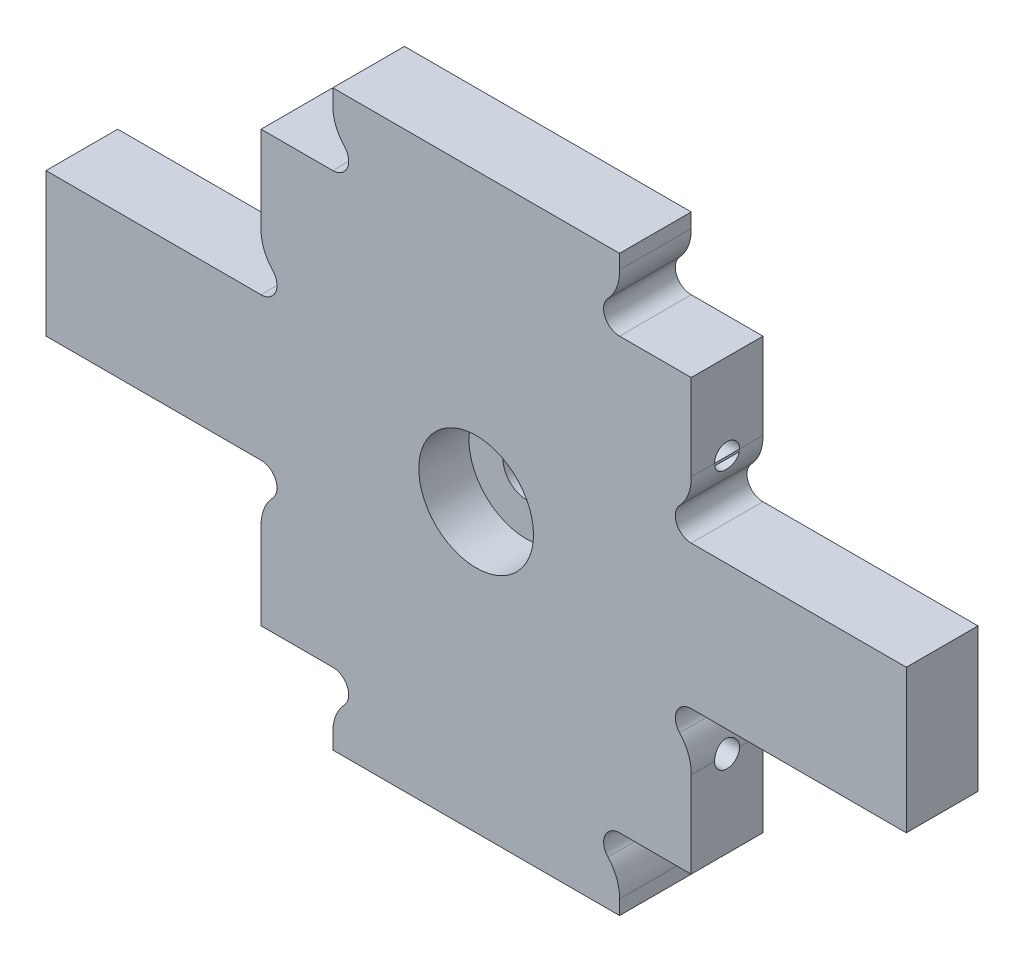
ISO-10303-21;
HEADER;
FILE_DESCRIPTION(('STEP AP214'),'2;1');
FILE_NAME('part.step','',(''),(''),'','','');
FILE_SCHEMA(('AUTOMOTIVE_DESIGN { 1 0 10303 214 1 1 1 1 }'));
ENDSEC;
DATA;
#1=APPLICATION_CONTEXT('core data for automotive mechanical design processes');
#2=APPLICATION_PROTOCOL_DEFINITION('international standard','automotive_design',2000,#1);
#3=PRODUCT_CONTEXT('',#1,'mechanical');
#4=PRODUCT('Part','Part','',(#3));
#5=PRODUCT_RELATED_PRODUCT_CATEGORY('part','',(#4));
#6=PRODUCT_DEFINITION_FORMATION('','',#4);
#7=PRODUCT_DEFINITION_CONTEXT('part definition',#1,'design');
#8=PRODUCT_DEFINITION('design','',#6,#7);
#9=PRODUCT_DEFINITION_SHAPE('','',#8);
#10=(LENGTH_UNIT() NAMED_UNIT(*) SI_UNIT(.MILLI.,.METRE.));
#11=(NAMED_UNIT(*) PLANE_ANGLE_UNIT() SI_UNIT($,.RADIAN.));
#12=(NAMED_UNIT(*) SI_UNIT($,.STERADIAN.) SOLID_ANGLE_UNIT());
#13=UNCERTAINTY_MEASURE_WITH_UNIT(LENGTH_MEASURE(1.E-05),#10,'distance_accuracy_value','');
#14=(GEOMETRIC_REPRESENTATION_CONTEXT(3) GLOBAL_UNCERTAINTY_ASSIGNED_CONTEXT((#13)) GLOBAL_UNIT_ASSIGNED_CONTEXT((#10,
#11,#12)) REPRESENTATION_CONTEXT('',''));
#15=CARTESIAN_POINT('',(0.,0.,0.));
#16=DIRECTION('',(0.,0.,1.));
#17=DIRECTION('',(1.,0.,0.));
#18=AXIS2_PLACEMENT_3D('',#15,#16,#17);
#19=CARTESIAN_POINT('',(-29.9978281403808,-30.,10.));
#20=DIRECTION('',(0.,1.,0.));
#21=DIRECTION('',(-1.,0.,0.));
#22=AXIS2_PLACEMENT_3D('',#19,#20,#21);
#23=PLANE('',#22);
#24=DIRECTION('',(0.,0.,1.));
#25=VECTOR('',#24,1.);
#26=CARTESIAN_POINT('',(20.,-30.,0.));
#27=LINE('',#26,#25);
#28=CARTESIAN_POINT('',(20.,-30.,0.));
#29=VERTEX_POINT('',#28);
#30=CARTESIAN_POINT('',(20.,-30.,10.));
#31=VERTEX_POINT('',#30);
#32=EDGE_CURVE('E396',#29,#31,#27,.T.);
#33=ORIENTED_EDGE('',*,*,#32,.F.);
#34=DIRECTION('',(1.,0.,0.));
#35=VECTOR('',#34,1.);
#36=CARTESIAN_POINT('',(-29.9978281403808,-30.,0.));
#37=LINE('',#36,#35);
#38=CARTESIAN_POINT('',(29.9978281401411,-30.,0.));
#39=VERTEX_POINT('',#38);
#40=EDGE_CURVE('E650',#29,#39,#37,.T.);
#41=ORIENTED_EDGE('',*,*,#40,.T.);
#42=DIRECTION('',(0.,0.,-1.));
#43=VECTOR('',#42,1.);
#44=CARTESIAN_POINT('',(29.9978281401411,-30.,10.));
#45=LINE('',#44,#43);
#46=CARTESIAN_POINT('',(29.9978281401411,-30.,10.));
#47=VERTEX_POINT('',#46);
#48=EDGE_CURVE('E703',#47,#39,#45,.T.);
#49=ORIENTED_EDGE('',*,*,#48,.F.);
#50=DIRECTION('',(1.,0.,0.));
#51=VECTOR('',#50,1.);
#52=CARTESIAN_POINT('',(-29.9978281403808,-30.,10.));
#53=LINE('',#52,#51);
#54=EDGE_CURVE('E62',#31,#47,#53,.T.);
#55=ORIENTED_EDGE('',*,*,#54,.F.);
#56=EDGE_LOOP('',(#33,#41,#49,#55));
#57=FACE_BOUND('',#56,.T.);
#58=ADVANCED_FACE('F45',(#57),#23,.F.);
#59=CARTESIAN_POINT('',(30.,30.,10.));
#60=DIRECTION('',(0.,-1.,0.));
#61=DIRECTION('',(1.,0.,0.));
#62=AXIS2_PLACEMENT_3D('',#59,#60,#61);
#63=PLANE('',#62);
#64=DIRECTION('',(0.,0.,1.));
#65=VECTOR('',#64,1.);
#66=CARTESIAN_POINT('',(20.,30.,0.));
#67=LINE('',#66,#65);
#68=CARTESIAN_POINT('',(20.,30.,0.));
#69=VERTEX_POINT('',#68);
#70=CARTESIAN_POINT('',(20.,30.,10.));
#71=VERTEX_POINT('',#70);
#72=EDGE_CURVE('E492',#69,#71,#67,.T.);
#73=ORIENTED_EDGE('',*,*,#72,.T.);
#74=DIRECTION('',(-1.,0.,0.));
#75=VECTOR('',#74,1.);
#76=CARTESIAN_POINT('',(30.,30.,10.));
#77=LINE('',#76,#75);
#78=CARTESIAN_POINT('',(30.,30.,10.));
#79=VERTEX_POINT('',#78);
#80=EDGE_CURVE('E555',#79,#71,#77,.T.);
#81=ORIENTED_EDGE('',*,*,#80,.F.);
#82=DIRECTION('',(0.,0.,-1.));
#83=VECTOR('',#82,1.);
#84=CARTESIAN_POINT('',(30.,30.,10.));
#85=LINE('',#84,#83);
#86=CARTESIAN_POINT('',(30.,30.,0.));
#87=VERTEX_POINT('',#86);
#88=EDGE_CURVE('E750',#79,#87,#85,.T.);
#89=ORIENTED_EDGE('',*,*,#88,.T.);
#90=DIRECTION('',(-1.,0.,0.));
#91=VECTOR('',#90,1.);
#92=CARTESIAN_POINT('',(30.,30.,0.));
#93=LINE('',#92,#91);
#94=EDGE_CURVE('E618',#87,#69,#93,.T.);
#95=ORIENTED_EDGE('',*,*,#94,.T.);
#96=EDGE_LOOP('',(#73,#81,#89,#95));
#97=FACE_BOUND('',#96,.T.);
#98=ADVANCED_FACE('F807',(#97),#63,.F.);
#99=CARTESIAN_POINT('',(0.,0.,0.));
#100=DIRECTION('',(0.,0.,1.));
#101=DIRECTION('',(1.,0.,0.));
#102=AXIS2_PLACEMENT_3D('',#99,#100,#101);
#103=CYLINDRICAL_SURFACE('',#102,3.25);
#104=CARTESIAN_POINT('',(0.,0.,0.));
#105=DIRECTION('',(0.,0.,1.));
#106=DIRECTION('',(1.,0.,0.));
#107=AXIS2_PLACEMENT_3D('',#104,#105,#106);
#108=CIRCLE('',#107,3.25);
#109=CARTESIAN_POINT('',(3.25,0.,0.));
#110=VERTEX_POINT('',#109);
#111=EDGE_CURVE('E541',#110,#110,#108,.T.);
#112=ORIENTED_EDGE('',*,*,#111,.F.);
#113=EDGE_LOOP('',(#112));
#114=FACE_BOUND('',#113,.T.);
#115=CARTESIAN_POINT('',(0.,0.,3.));
#116=DIRECTION('',(0.,0.,1.));
#117=DIRECTION('',(1.,0.,0.));
#118=AXIS2_PLACEMENT_3D('',#115,#116,#117);
#119=CIRCLE('',#118,3.25);
#120=CARTESIAN_POINT('',(3.25,0.,3.));
#121=VERTEX_POINT('',#120);
#122=EDGE_CURVE('E537',#121,#121,#119,.F.);
#123=ORIENTED_EDGE('',*,*,#122,.F.);
#124=EDGE_LOOP('',(#123));
#125=FACE_BOUND('',#124,.T.);
#126=ADVANCED_FACE('F804',(#114,#125),#103,.F.);
#127=CARTESIAN_POINT('',(24.0021116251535,17.8408301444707,10.));
#128=DIRECTION('',(0.,0.,-1.));
#129=DIRECTION('',(-1.,0.,0.));
#130=AXIS2_PLACEMENT_3D('',#127,#128,#129);
#131=CYLINDRICAL_SURFACE('',#130,6.00000000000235);
#132=CARTESIAN_POINT('',(30.,17.6816602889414,3.27919791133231));
#133=CARTESIAN_POINT('',(29.9987313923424,17.6337424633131,3.28806184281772));
#134=CARTESIAN_POINT('',(29.9968924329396,17.5862353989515,3.29892223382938));
#135=CARTESIAN_POINT('',(29.9921670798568,17.4923496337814,3.32454189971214));
#136=CARTESIAN_POINT('',(29.989280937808,17.4459706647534,3.33930023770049));
#137=CARTESIAN_POINT('',(29.9792095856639,17.3092146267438,3.38919308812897));
#138=CARTESIAN_POINT('',(29.9706030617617,17.2209391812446,3.42999758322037));
#139=CARTESIAN_POINT('',(29.9507233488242,17.0526542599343,3.52541371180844));
#140=CARTESIAN_POINT('',(29.9394511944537,16.9726415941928,3.58001998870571));
#141=CARTESIAN_POINT('',(29.9155983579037,16.8227748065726,3.70155930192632));
#142=CARTESIAN_POINT('',(29.9030172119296,16.7529243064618,3.76849671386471));
#143=CARTESIAN_POINT('',(29.8777467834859,16.6237217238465,3.91460477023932));
#144=CARTESIAN_POINT('',(29.8650614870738,16.5646427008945,3.99401777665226));
#145=CARTESIAN_POINT('',(29.8414450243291,16.4605977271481,4.16185492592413));
#146=CARTESIAN_POINT('',(29.8305138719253,16.4156318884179,4.2502791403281));
#147=CARTESIAN_POINT('',(29.8118198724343,16.3412405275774,4.43361922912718));
#148=CARTESIAN_POINT('',(29.8040524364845,16.3117924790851,4.52852546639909));
#149=CARTESIAN_POINT('',(29.7927035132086,16.2693540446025,4.72218092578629));
#150=CARTESIAN_POINT('',(29.7891208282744,16.256358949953,4.82092904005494));
#151=CARTESIAN_POINT('',(29.7866706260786,16.2474389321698,5.01603437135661));
#152=CARTESIAN_POINT('',(29.7876541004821,16.2509745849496,5.11236539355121));
#153=CARTESIAN_POINT('',(29.7938668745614,16.2737603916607,5.30300554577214));
#154=CARTESIAN_POINT('',(29.7990961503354,16.2930104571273,5.39731468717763));
#155=CARTESIAN_POINT('',(29.8130743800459,16.3463546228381,5.58050609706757));
#156=CARTESIAN_POINT('',(29.8217943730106,16.380326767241,5.6694262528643));
#157=CARTESIAN_POINT('',(29.8416979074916,16.4620650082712,5.84037847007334));
#158=CARTESIAN_POINT('',(29.852881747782,16.5098327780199,5.92240969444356));
#159=CARTESIAN_POINT('',(29.8767647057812,16.6194848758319,6.07988667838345));
#160=CARTESIAN_POINT('',(29.8894989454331,16.6817461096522,6.15506471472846));
#161=CARTESIAN_POINT('',(29.914681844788,16.8179421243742,6.2941067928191));
#162=CARTESIAN_POINT('',(29.9271303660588,16.8918824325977,6.3579654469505));
#163=CARTESIAN_POINT('',(29.9504593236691,17.0510508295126,6.47372665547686));
#164=CARTESIAN_POINT('',(29.9613048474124,17.1364692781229,6.52537458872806));
#165=CARTESIAN_POINT('',(29.9797000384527,17.3150510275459,6.61344855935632));
#166=CARTESIAN_POINT('',(29.9872558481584,17.4081995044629,6.64990295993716));
#167=CARTESIAN_POINT('',(29.9942830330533,17.5330112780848,6.68681922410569));
#168=CARTESIAN_POINT('',(29.9957265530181,17.5625013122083,6.69470639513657));
#169=CARTESIAN_POINT('',(29.9981864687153,17.6218268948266,6.70892101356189));
#170=CARTESIAN_POINT('',(29.9992034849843,17.6516618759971,6.7152507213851));
#171=CARTESIAN_POINT('',(30.,17.6816602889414,6.72080208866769));
#172=B_SPLINE_CURVE_WITH_KNOTS('',3,(#132,#133,#134,#135,#136,#137,#138,#139,#140,#141,#142,
#143,#144,#145,#146,#147,#148,#149,#150,#151,#152,#153,#154,#155,#156,#157,#158,#159,#160,#161,
#162,#163,#164,#165,#166,#167,#168,#169,#170,#171),.UNSPECIFIED.,.F.,.F.,(4,2,2,2,2,2,2,2,2,2,2,
2,2,2,2,2,2,2,2,4),(0.,0.146146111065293,0.292257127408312,0.583637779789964,0.874905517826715,
1.16627680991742,1.4642356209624,1.76219679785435,2.05972423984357,2.35716651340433,
2.64497179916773,2.93277546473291,3.21823925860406,3.50373768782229,3.79770983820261,
4.09182153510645,4.39161125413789,4.69083879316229,4.7824893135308,4.8740060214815),.UNSPECIFIED.);
#173=CARTESIAN_POINT('',(30.,17.6816602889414,3.27919791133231));
#174=VERTEX_POINT('',#173);
#175=CARTESIAN_POINT('',(30.,17.6816602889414,6.72080208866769));
#176=VERTEX_POINT('',#175);
#177=EDGE_CURVE('E773',#174,#176,#172,.T.);
#178=ORIENTED_EDGE('',*,*,#177,.T.);
#179=DIRECTION('',(0.,0.,-1.));
#180=VECTOR('',#179,1.);
#181=CARTESIAN_POINT('',(30.,17.6816602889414,10.));
#182=LINE('',#181,#180);
#183=EDGE_CURVE('E1009',#176,#174,#182,.T.);
#184=ORIENTED_EDGE('',*,*,#183,.T.);
#185=EDGE_LOOP('',(#178,#184));
#186=FACE_BOUND('',#185,.T.);
#187=CARTESIAN_POINT('',(24.0021116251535,17.8408301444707,0.));
#188=DIRECTION('',(0.,0.,1.));
#189=DIRECTION('',(-1.,0.,0.));
#190=AXIS2_PLACEMENT_3D('',#187,#188,#189);
#191=CIRCLE('',#190,6.00000000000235);
#192=CARTESIAN_POINT('',(28.3795620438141,13.7374257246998,0.));
#193=VERTEX_POINT('',#192);
#194=CARTESIAN_POINT('',(30.,18.,0.));
#195=VERTEX_POINT('',#194);
#196=EDGE_CURVE('E545',#193,#195,#191,.T.);
#197=ORIENTED_EDGE('',*,*,#196,.T.);
#198=DIRECTION('',(0.,0.,-1.));
#199=VECTOR('',#198,1.);
#200=CARTESIAN_POINT('',(30.,18.,10.));
#201=LINE('',#200,#199);
#202=CARTESIAN_POINT('',(30.,18.,3.25000000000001));
#203=VERTEX_POINT('',#202);
#204=EDGE_CURVE('E754',#203,#195,#201,.T.);
#205=ORIENTED_EDGE('',*,*,#204,.F.);
#206=CARTESIAN_POINT('',(30.,18.,6.74999999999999));
#207=VERTEX_POINT('',#206);
#208=EDGE_CURVE('E760',#207,#203,#201,.T.);
#209=ORIENTED_EDGE('',*,*,#208,.F.);
#210=CARTESIAN_POINT('',(30.,18.,10.));
#211=VERTEX_POINT('',#210);
#212=EDGE_CURVE('E755',#211,#207,#201,.T.);
#213=ORIENTED_EDGE('',*,*,#212,.F.);
#214=CARTESIAN_POINT('',(24.0021116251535,17.8408301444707,10.));
#215=DIRECTION('',(0.,0.,1.));
#216=DIRECTION('',(-1.,0.,0.));
#217=AXIS2_PLACEMENT_3D('',#214,#215,#216);
#218=CIRCLE('',#217,6.00000000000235);
#219=CARTESIAN_POINT('',(28.3795620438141,13.7374257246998,10.));
#220=VERTEX_POINT('',#219);
#221=EDGE_CURVE('E546',#220,#211,#218,.T.);
#222=ORIENTED_EDGE('',*,*,#221,.F.);
#223=DIRECTION('',(0.,0.,-1.));
#224=VECTOR('',#223,1.);
#225=CARTESIAN_POINT('',(28.3795620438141,13.7374257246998,10.));
#226=LINE('',#225,#224);
#227=EDGE_CURVE('E610',#220,#193,#226,.T.);
#228=ORIENTED_EDGE('',*,*,#227,.T.);
#229=EDGE_LOOP('',(#197,#205,#209,#213,#222,#228));
#230=FACE_BOUND('',#229,.T.);
#231=ADVANCED_FACE('F47',(#186,#230),#131,.T.);
#232=CARTESIAN_POINT('',(30.,30.,10.));
#233=DIRECTION('',(-1.,0.,0.));
#234=DIRECTION('',(0.,-1.,0.));
#235=AXIS2_PLACEMENT_3D('',#232,#233,#234);
#236=PLANE('',#235);
#237=ORIENTED_EDGE('',*,*,#212,.T.);
#238=CARTESIAN_POINT('',(30.,18.,5.));
#239=DIRECTION('',(1.,0.,0.));
#240=DIRECTION('',(0.,0.,-1.));
#241=AXIS2_PLACEMENT_3D('',#238,#239,#240);
#242=CIRCLE('',#241,1.74999999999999);
#243=EDGE_CURVE('E515',#203,#207,#242,.T.);
#244=ORIENTED_EDGE('',*,*,#243,.F.);
#245=ORIENTED_EDGE('',*,*,#204,.T.);
#246=DIRECTION('',(0.,1.,0.));
#247=VECTOR('',#246,1.);
#248=CARTESIAN_POINT('',(30.,30.,0.));
#249=LINE('',#248,#247);
#250=EDGE_CURVE('E614',#195,#87,#249,.T.);
#251=ORIENTED_EDGE('',*,*,#250,.T.);
#252=ORIENTED_EDGE('',*,*,#88,.F.);
#253=DIRECTION('',(0.,1.,0.));
#254=VECTOR('',#253,1.);
#255=CARTESIAN_POINT('',(30.,30.,10.));
#256=LINE('',#255,#254);
#257=EDGE_CURVE('E550',#211,#79,#256,.T.);
#258=ORIENTED_EDGE('',*,*,#257,.F.);
#259=EDGE_LOOP('',(#237,#244,#245,#251,#252,#258));
#260=FACE_BOUND('',#259,.T.);
#261=ADVANCED_FACE('F945',(#260),#236,.F.);
#262=CARTESIAN_POINT('',(-20.,30.,10.));
#263=VERTEX_POINT('',#262);
#264=CARTESIAN_POINT('',(-30.,30.,10.));
#265=VERTEX_POINT('',#264);
#266=EDGE_CURVE('E554',#263,#265,#77,.T.);
#267=ORIENTED_EDGE('',*,*,#266,.F.);
#268=DIRECTION('',(0.,0.,1.));
#269=VECTOR('',#268,1.);
#270=CARTESIAN_POINT('',(-20.,30.,0.));
#271=LINE('',#270,#269);
#272=CARTESIAN_POINT('',(-20.,30.,0.));
#273=VERTEX_POINT('',#272);
#274=EDGE_CURVE('E446',#273,#263,#271,.T.);
#275=ORIENTED_EDGE('',*,*,#274,.F.);
#276=CARTESIAN_POINT('',(-30.,30.,0.));
#277=VERTEX_POINT('',#276);
#278=EDGE_CURVE('E617',#273,#277,#93,.T.);
#279=ORIENTED_EDGE('',*,*,#278,.T.);
#280=DIRECTION('',(0.,0.,-1.));
#281=VECTOR('',#280,1.);
#282=CARTESIAN_POINT('',(-30.,30.,10.));
#283=LINE('',#282,#281);
#284=EDGE_CURVE('E745',#265,#277,#283,.T.);
#285=ORIENTED_EDGE('',*,*,#284,.F.);
#286=EDGE_LOOP('',(#267,#275,#279,#285));
#287=FACE_BOUND('',#286,.T.);
#288=ADVANCED_FACE('F850',(#287),#63,.F.);
#289=CARTESIAN_POINT('',(-30.,30.,10.));
#290=DIRECTION('',(1.,0.,0.));
#291=DIRECTION('',(0.,1.,0.));
#292=AXIS2_PLACEMENT_3D('',#289,#290,#291);
#293=PLANE('',#292);
#294=DIRECTION('',(0.,0.,-1.));
#295=VECTOR('',#294,1.);
#296=CARTESIAN_POINT('',(-30.,18.,10.));
#297=LINE('',#296,#295);
#298=CARTESIAN_POINT('',(-30.,18.,3.25000000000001));
#299=VERTEX_POINT('',#298);
#300=CARTESIAN_POINT('',(-30.,18.,0.));
#301=VERTEX_POINT('',#300);
#302=EDGE_CURVE('E740',#299,#301,#297,.T.);
#303=ORIENTED_EDGE('',*,*,#302,.F.);
#304=CARTESIAN_POINT('',(-30.,18.,5.));
#305=DIRECTION('',(-1.,0.,0.));
#306=DIRECTION('',(0.,0.,1.));
#307=AXIS2_PLACEMENT_3D('',#304,#305,#306);
#308=CIRCLE('',#307,1.74999999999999);
#309=CARTESIAN_POINT('',(-30.,18.,6.74999999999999));
#310=VERTEX_POINT('',#309);
#311=EDGE_CURVE('E498',#310,#299,#308,.T.);
#312=ORIENTED_EDGE('',*,*,#311,.F.);
#313=CARTESIAN_POINT('',(-30.,18.,10.));
#314=VERTEX_POINT('',#313);
#315=EDGE_CURVE('E741',#314,#310,#297,.T.);
#316=ORIENTED_EDGE('',*,*,#315,.F.);
#317=DIRECTION('',(0.,-1.,0.));
#318=VECTOR('',#317,1.);
#319=CARTESIAN_POINT('',(-30.,30.,10.));
#320=LINE('',#319,#318);
#321=EDGE_CURVE('E559',#265,#314,#320,.T.);
#322=ORIENTED_EDGE('',*,*,#321,.F.);
#323=ORIENTED_EDGE('',*,*,#284,.T.);
#324=DIRECTION('',(0.,-1.,0.));
#325=VECTOR('',#324,1.);
#326=CARTESIAN_POINT('',(-30.,30.,0.));
#327=LINE('',#326,#325);
#328=EDGE_CURVE('E621',#277,#301,#327,.T.);
#329=ORIENTED_EDGE('',*,*,#328,.T.);
#330=EDGE_LOOP('',(#303,#312,#316,#322,#323,#329));
#331=FACE_BOUND('',#330,.T.);
#332=ADVANCED_FACE('F906',(#331),#293,.F.);
#333=CARTESIAN_POINT('',(-24.0021116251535,17.8408301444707,10.));
#334=DIRECTION('',(0.,0.,-1.));
#335=DIRECTION('',(-1.,0.,0.));
#336=AXIS2_PLACEMENT_3D('',#333,#334,#335);
#337=CYLINDRICAL_SURFACE('',#336,6.00000000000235);
#338=CARTESIAN_POINT('',(-30.,17.6816602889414,6.72080208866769));
#339=CARTESIAN_POINT('',(-29.9987313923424,17.6337424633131,6.71193815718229));
#340=CARTESIAN_POINT('',(-29.9968924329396,17.5862353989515,6.70107776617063));
#341=CARTESIAN_POINT('',(-29.9921670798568,17.4923496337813,6.67545810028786));
#342=CARTESIAN_POINT('',(-29.989280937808,17.4459706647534,6.66069976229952));
#343=CARTESIAN_POINT('',(-29.9792095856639,17.3092146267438,6.61080691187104));
#344=CARTESIAN_POINT('',(-29.9706030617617,17.2209391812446,6.57000241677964));
#345=CARTESIAN_POINT('',(-29.9507233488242,17.0526542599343,6.47458628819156));
#346=CARTESIAN_POINT('',(-29.9394511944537,16.9726415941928,6.41998001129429));
#347=CARTESIAN_POINT('',(-29.9155983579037,16.8227748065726,6.29844069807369));
#348=CARTESIAN_POINT('',(-29.9030172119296,16.7529243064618,6.23150328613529));
#349=CARTESIAN_POINT('',(-29.8777467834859,16.6237217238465,6.08539522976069));
#350=CARTESIAN_POINT('',(-29.8650614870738,16.5646427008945,6.00598222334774));
#351=CARTESIAN_POINT('',(-29.8414450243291,16.4605977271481,5.83814507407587));
#352=CARTESIAN_POINT('',(-29.8305138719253,16.4156318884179,5.7497208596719));
#353=CARTESIAN_POINT('',(-29.8118198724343,16.3412405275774,5.56638077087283));
#354=CARTESIAN_POINT('',(-29.8040524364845,16.3117924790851,5.47147453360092));
#355=CARTESIAN_POINT('',(-29.7927035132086,16.2693540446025,5.27781907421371));
#356=CARTESIAN_POINT('',(-29.7891208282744,16.256358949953,5.17907095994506));
#357=CARTESIAN_POINT('',(-29.7866706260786,16.2474389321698,4.9839656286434));
#358=CARTESIAN_POINT('',(-29.7876541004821,16.2509745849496,4.88763460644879));
#359=CARTESIAN_POINT('',(-29.7938668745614,16.2737603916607,4.69699445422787));
#360=CARTESIAN_POINT('',(-29.7990961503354,16.2930104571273,4.60268531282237));
#361=CARTESIAN_POINT('',(-29.8130743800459,16.3463546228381,4.41949390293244));
#362=CARTESIAN_POINT('',(-29.8217943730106,16.380326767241,4.33057374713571));
#363=CARTESIAN_POINT('',(-29.8416979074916,16.4620650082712,4.15962152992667));
#364=CARTESIAN_POINT('',(-29.852881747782,16.5098327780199,4.07759030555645));
#365=CARTESIAN_POINT('',(-29.8767647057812,16.6194848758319,3.92011332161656));
#366=CARTESIAN_POINT('',(-29.8894989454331,16.6817461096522,3.84493528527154));
#367=CARTESIAN_POINT('',(-29.914681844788,16.8179421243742,3.70589320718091));
#368=CARTESIAN_POINT('',(-29.9271303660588,16.8918824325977,3.64203455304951));
#369=CARTESIAN_POINT('',(-29.9504593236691,17.0510508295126,3.52627334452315));
#370=CARTESIAN_POINT('',(-29.9613048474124,17.1364692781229,3.47462541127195));
#371=CARTESIAN_POINT('',(-29.9797000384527,17.3150510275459,3.38655144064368));
#372=CARTESIAN_POINT('',(-29.9872558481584,17.4081995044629,3.35009704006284));
#373=CARTESIAN_POINT('',(-29.9942830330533,17.5330112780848,3.31318077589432));
#374=CARTESIAN_POINT('',(-29.9957265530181,17.5625013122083,3.30529360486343));
#375=CARTESIAN_POINT('',(-29.9981864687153,17.6218268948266,3.29107898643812));
#376=CARTESIAN_POINT('',(-29.9992034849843,17.6516618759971,3.2847492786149));
#377=CARTESIAN_POINT('',(-30.,17.6816602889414,3.27919791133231));
#378=B_SPLINE_CURVE_WITH_KNOTS('',3,(#338,#339,#340,#341,#342,#343,#344,#345,#346,#347,#348,
#349,#350,#351,#352,#353,#354,#355,#356,#357,#358,#359,#360,#361,#362,#363,#364,#365,#366,#367,
#368,#369,#370,#371,#372,#373,#374,#375,#376,#377),.UNSPECIFIED.,.F.,.F.,(4,2,2,2,2,2,2,2,2,2,2,
2,2,2,2,2,2,2,2,4),(0.,0.146146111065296,0.292257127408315,0.583637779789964,0.874905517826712,
1.16627680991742,1.4642356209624,1.76219679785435,2.05972423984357,2.35716651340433,
2.64497179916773,2.93277546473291,3.21823925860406,3.50373768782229,3.79770983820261,
4.09182153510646,4.39161125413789,4.69083879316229,4.7824893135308,4.87400602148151),.UNSPECIFIED.);
#379=CARTESIAN_POINT('',(-30.,17.6816602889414,6.72080208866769));
#380=VERTEX_POINT('',#379);
#381=CARTESIAN_POINT('',(-30.,17.6816602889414,3.27919791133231));
#382=VERTEX_POINT('',#381);
#383=EDGE_CURVE('E55',#380,#382,#378,.T.);
#384=ORIENTED_EDGE('',*,*,#383,.T.);
#385=DIRECTION('',(0.,0.,-1.));
#386=VECTOR('',#385,1.);
#387=CARTESIAN_POINT('',(-30.,17.6816602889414,10.));
#388=LINE('',#387,#386);
#389=EDGE_CURVE('E11',#382,#380,#388,.F.);
#390=ORIENTED_EDGE('',*,*,#389,.T.);
#391=EDGE_LOOP('',(#384,#390));
#392=FACE_BOUND('',#391,.T.);
#393=CARTESIAN_POINT('',(-24.0021116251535,17.8408301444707,0.));
#394=DIRECTION('',(0.,0.,1.));
#395=DIRECTION('',(1.,0.,0.));
#396=AXIS2_PLACEMENT_3D('',#393,#394,#395);
#397=CIRCLE('',#396,6.00000000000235);
#398=CARTESIAN_POINT('',(-28.3795620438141,13.7374257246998,0.));
#399=VERTEX_POINT('',#398);
#400=EDGE_CURVE('E625',#301,#399,#397,.T.);
#401=ORIENTED_EDGE('',*,*,#400,.T.);
#402=DIRECTION('',(0.,0.,-1.));
#403=VECTOR('',#402,1.);
#404=CARTESIAN_POINT('',(-28.3795620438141,13.7374257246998,10.));
#405=LINE('',#404,#403);
#406=CARTESIAN_POINT('',(-28.3795620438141,13.7374257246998,10.));
#407=VERTEX_POINT('',#406);
#408=EDGE_CURVE('E736',#407,#399,#405,.T.);
#409=ORIENTED_EDGE('',*,*,#408,.F.);
#410=CARTESIAN_POINT('',(-24.0021116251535,17.8408301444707,10.));
#411=DIRECTION('',(0.,0.,1.));
#412=DIRECTION('',(1.,0.,0.));
#413=AXIS2_PLACEMENT_3D('',#410,#411,#412);
#414=CIRCLE('',#413,6.00000000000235);
#415=EDGE_CURVE('E562',#314,#407,#414,.T.);
#416=ORIENTED_EDGE('',*,*,#415,.F.);
#417=ORIENTED_EDGE('',*,*,#315,.T.);
#418=EDGE_CURVE('E746',#310,#299,#297,.T.);
#419=ORIENTED_EDGE('',*,*,#418,.T.);
#420=ORIENTED_EDGE('',*,*,#302,.T.);
#421=EDGE_LOOP('',(#401,#409,#416,#417,#419,#420));
#422=FACE_BOUND('',#421,.T.);
#423=ADVANCED_FACE('F900',(#392,#422),#337,.T.);
#424=CARTESIAN_POINT('',(-30.000000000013,12.2199999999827,10.));
#425=DIRECTION('',(0.,0.,-1.));
#426=DIRECTION('',(-1.,0.,0.));
#427=AXIS2_PLACEMENT_3D('',#424,#425,#426);
#428=CYLINDRICAL_SURFACE('',#427,2.21999999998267);
#429=CARTESIAN_POINT('',(-30.000000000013,12.2199999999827,0.));
#430=DIRECTION('',(0.,0.,-1.));
#431=DIRECTION('',(1.,0.,0.));
#432=AXIS2_PLACEMENT_3D('',#429,#430,#431);
#433=CIRCLE('',#432,2.21999999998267);
#434=CARTESIAN_POINT('',(-30.000000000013,10.,0.));
#435=VERTEX_POINT('',#434);
#436=EDGE_CURVE('E628',#399,#435,#433,.T.);
#437=ORIENTED_EDGE('',*,*,#436,.T.);
#438=DIRECTION('',(0.,0.,-1.));
#439=VECTOR('',#438,1.);
#440=CARTESIAN_POINT('',(-30.000000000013,10.,10.));
#441=LINE('',#440,#439);
#442=CARTESIAN_POINT('',(-30.000000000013,10.,10.));
#443=VERTEX_POINT('',#442);
#444=EDGE_CURVE('E732',#443,#435,#441,.T.);
#445=ORIENTED_EDGE('',*,*,#444,.F.);
#446=CARTESIAN_POINT('',(-30.000000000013,12.2199999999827,10.));
#447=DIRECTION('',(0.,0.,-1.));
#448=DIRECTION('',(1.,0.,0.));
#449=AXIS2_PLACEMENT_3D('',#446,#447,#448);
#450=CIRCLE('',#449,2.21999999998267);
#451=EDGE_CURVE('E565',#407,#443,#450,.T.);
#452=ORIENTED_EDGE('',*,*,#451,.F.);
#453=ORIENTED_EDGE('',*,*,#408,.T.);
#454=EDGE_LOOP('',(#437,#445,#452,#453));
#455=FACE_BOUND('',#454,.T.);
#456=ADVANCED_FACE('F895',(#455),#428,.F.);
#457=CARTESIAN_POINT('',(-30.000000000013,10.,10.));
#458=DIRECTION('',(0.,-1.,0.));
#459=DIRECTION('',(0.,0.,-1.));
#460=AXIS2_PLACEMENT_3D('',#457,#458,#459);
#461=PLANE('',#460);
#462=DIRECTION('',(-1.,0.,0.));
#463=VECTOR('',#462,1.);
#464=CARTESIAN_POINT('',(-30.000000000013,10.,0.));
#465=LINE('',#464,#463);
#466=CARTESIAN_POINT('',(-60.,10.,0.));
#467=VERTEX_POINT('',#466);
#468=EDGE_CURVE('E631',#435,#467,#465,.T.);
#469=ORIENTED_EDGE('',*,*,#468,.T.);
#470=DIRECTION('',(0.,0.,-1.));
#471=VECTOR('',#470,1.);
#472=CARTESIAN_POINT('',(-60.,10.,10.));
#473=LINE('',#472,#471);
#474=CARTESIAN_POINT('',(-60.,10.,10.));
#475=VERTEX_POINT('',#474);
#476=EDGE_CURVE('E728',#475,#467,#473,.T.);
#477=ORIENTED_EDGE('',*,*,#476,.F.);
#478=DIRECTION('',(-1.,0.,0.));
#479=VECTOR('',#478,1.);
#480=CARTESIAN_POINT('',(-30.000000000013,10.,10.));
#481=LINE('',#480,#479);
#482=EDGE_CURVE('E568',#443,#475,#481,.T.);
#483=ORIENTED_EDGE('',*,*,#482,.F.);
#484=ORIENTED_EDGE('',*,*,#444,.T.);
#485=EDGE_LOOP('',(#469,#477,#483,#484));
#486=FACE_BOUND('',#485,.T.);
#487=ADVANCED_FACE('F889',(#486),#461,.F.);
#488=CARTESIAN_POINT('',(-60.,10.,10.));
#489=DIRECTION('',(1.,0.,0.));
#490=DIRECTION('',(0.,0.,-1.));
#491=AXIS2_PLACEMENT_3D('',#488,#489,#490);
#492=PLANE('',#491);
#493=DIRECTION('',(0.,-1.,0.));
#494=VECTOR('',#493,1.);
#495=CARTESIAN_POINT('',(-60.,10.,0.));
#496=LINE('',#495,#494);
#497=CARTESIAN_POINT('',(-60.,-10.,0.));
#498=VERTEX_POINT('',#497);
#499=EDGE_CURVE('E634',#467,#498,#496,.T.);
#500=ORIENTED_EDGE('',*,*,#499,.T.);
#501=DIRECTION('',(0.,0.,-1.));
#502=VECTOR('',#501,1.);
#503=CARTESIAN_POINT('',(-60.,-10.,10.));
#504=LINE('',#503,#502);
#505=CARTESIAN_POINT('',(-60.,-10.,10.));
#506=VERTEX_POINT('',#505);
#507=EDGE_CURVE('E724',#506,#498,#504,.T.);
#508=ORIENTED_EDGE('',*,*,#507,.F.);
#509=DIRECTION('',(0.,-1.,0.));
#510=VECTOR('',#509,1.);
#511=CARTESIAN_POINT('',(-60.,10.,10.));
#512=LINE('',#511,#510);
#513=EDGE_CURVE('E571',#475,#506,#512,.T.);
#514=ORIENTED_EDGE('',*,*,#513,.F.);
#515=ORIENTED_EDGE('',*,*,#476,.T.);
#516=EDGE_LOOP('',(#500,#508,#514,#515));
#517=FACE_BOUND('',#516,.T.);
#518=ADVANCED_FACE('F885',(#517),#492,.F.);
#519=CARTESIAN_POINT('',(-60.,-10.,10.));
#520=DIRECTION('',(0.,1.,0.));
#521=DIRECTION('',(-1.,0.,0.));
#522=AXIS2_PLACEMENT_3D('',#519,#520,#521);
#523=PLANE('',#522);
#524=DIRECTION('',(1.,0.,0.));
#525=VECTOR('',#524,1.);
#526=CARTESIAN_POINT('',(-60.,-10.,0.));
#527=LINE('',#526,#525);
#528=CARTESIAN_POINT('',(-30.000000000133,-9.99999999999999,0.));
#529=VERTEX_POINT('',#528);
#530=EDGE_CURVE('E637',#498,#529,#527,.T.);
#531=ORIENTED_EDGE('',*,*,#530,.T.);
#532=DIRECTION('',(0.,0.,-1.));
#533=VECTOR('',#532,1.);
#534=CARTESIAN_POINT('',(-30.000000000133,-9.99999999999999,10.));
#535=LINE('',#534,#533);
#536=CARTESIAN_POINT('',(-30.000000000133,-9.99999999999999,10.));
#537=VERTEX_POINT('',#536);
#538=EDGE_CURVE('E720',#537,#529,#535,.T.);
#539=ORIENTED_EDGE('',*,*,#538,.F.);
#540=DIRECTION('',(1.,0.,0.));
#541=VECTOR('',#540,1.);
#542=CARTESIAN_POINT('',(-60.,-10.,10.));
#543=LINE('',#542,#541);
#544=EDGE_CURVE('E574',#506,#537,#543,.T.);
#545=ORIENTED_EDGE('',*,*,#544,.F.);
#546=ORIENTED_EDGE('',*,*,#507,.T.);
#547=EDGE_LOOP('',(#531,#539,#545,#546));
#548=FACE_BOUND('',#547,.T.);
#549=ADVANCED_FACE('F880',(#548),#523,.F.);
#550=CARTESIAN_POINT('',(-30.000000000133,-12.2200000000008,10.));
#551=DIRECTION('',(0.,0.,-1.));
#552=DIRECTION('',(-1.,0.,0.));
#553=AXIS2_PLACEMENT_3D('',#550,#551,#552);
#554=CYLINDRICAL_SURFACE('',#553,2.22000000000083);
#555=CARTESIAN_POINT('',(-30.000000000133,-12.2200000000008,0.));
#556=DIRECTION('',(0.,0.,-1.));
#557=DIRECTION('',(1.,0.,0.));
#558=AXIS2_PLACEMENT_3D('',#555,#556,#557);
#559=CIRCLE('',#558,2.22000000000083);
#560=CARTESIAN_POINT('',(-28.3795620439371,-13.7374257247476,0.));
#561=VERTEX_POINT('',#560);
#562=EDGE_CURVE('E640',#529,#561,#559,.T.);
#563=ORIENTED_EDGE('',*,*,#562,.T.);
#564=DIRECTION('',(0.,0.,-1.));
#565=VECTOR('',#564,1.);
#566=CARTESIAN_POINT('',(-28.3795620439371,-13.7374257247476,10.));
#567=LINE('',#566,#565);
#568=CARTESIAN_POINT('',(-28.3795620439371,-13.7374257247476,10.));
#569=VERTEX_POINT('',#568);
#570=EDGE_CURVE('E716',#569,#561,#567,.T.);
#571=ORIENTED_EDGE('',*,*,#570,.F.);
#572=CARTESIAN_POINT('',(-30.000000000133,-12.2200000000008,10.));
#573=DIRECTION('',(0.,0.,-1.));
#574=DIRECTION('',(1.,0.,0.));
#575=AXIS2_PLACEMENT_3D('',#572,#573,#574);
#576=CIRCLE('',#575,2.22000000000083);
#577=EDGE_CURVE('E577',#537,#569,#576,.T.);
#578=ORIENTED_EDGE('',*,*,#577,.F.);
#579=ORIENTED_EDGE('',*,*,#538,.T.);
#580=EDGE_LOOP('',(#563,#571,#578,#579));
#581=FACE_BOUND('',#580,.T.);
#582=ADVANCED_FACE('F874',(#581),#554,.F.);
#583=CARTESIAN_POINT('',(-24.0000000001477,-17.8385763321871,10.));
#584=DIRECTION('',(0.,0.,-1.));
#585=DIRECTION('',(-1.,0.,0.));
#586=AXIS2_PLACEMENT_3D('',#583,#584,#585);
#587=CYLINDRICAL_SURFACE('',#586,6.00000000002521);
#588=DIRECTION('',(0.,0.,-1.));
#589=VECTOR('',#588,1.);
#590=CARTESIAN_POINT('',(-29.9978281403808,-18.,10.));
#591=LINE('',#590,#589);
#592=CARTESIAN_POINT('',(-29.9978281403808,-18.,3.25000000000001));
#593=VERTEX_POINT('',#592);
#594=CARTESIAN_POINT('',(-29.9978281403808,-18.,0.));
#595=VERTEX_POINT('',#594);
#596=EDGE_CURVE('E711',#593,#595,#591,.T.);
#597=ORIENTED_EDGE('',*,*,#596,.F.);
#598=CARTESIAN_POINT('',(-29.9978281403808,-18.,3.25000000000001));
#599=CARTESIAN_POINT('',(-29.9991213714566,-17.9520643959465,3.2499992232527));
#600=CARTESIAN_POINT('',(-29.9998323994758,-17.9041364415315,3.25197087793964));
#601=CARTESIAN_POINT('',(-30.000114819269,-17.8086077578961,3.25983702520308));
#602=CARTESIAN_POINT('',(-29.9996863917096,-17.7610069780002,3.26573089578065));
#603=CARTESIAN_POINT('',(-29.9967354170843,-17.6194289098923,3.28921586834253));
#604=CARTESIAN_POINT('',(-29.9925547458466,-17.5263796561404,3.31261066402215));
#605=CARTESIAN_POINT('',(-29.9804039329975,-17.3456267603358,3.37413859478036));
#606=CARTESIAN_POINT('',(-29.9724339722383,-17.2579228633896,3.41227102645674));
#607=CARTESIAN_POINT('',(-29.9537286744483,-17.0900779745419,3.50213360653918));
#608=CARTESIAN_POINT('',(-29.9429925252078,-17.0099392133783,3.55386774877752));
#609=CARTESIAN_POINT('',(-29.9197837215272,-16.8576436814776,3.67074012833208));
#610=CARTESIAN_POINT('',(-29.9072790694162,-16.7856922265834,3.73613935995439));
#611=CARTESIAN_POINT('',(-29.8822022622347,-16.6535752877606,3.87793332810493));
#612=CARTESIAN_POINT('',(-29.8696300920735,-16.5934125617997,3.95433063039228));
#613=CARTESIAN_POINT('',(-29.8456500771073,-16.4852381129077,4.11804831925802));
#614=CARTESIAN_POINT('',(-29.8342754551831,-16.4375359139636,4.20557863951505));
#615=CARTESIAN_POINT('',(-29.8144966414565,-16.3575847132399,4.38774150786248));
#616=CARTESIAN_POINT('',(-29.8060918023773,-16.3253323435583,4.48237250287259));
#617=CARTESIAN_POINT('',(-29.7935011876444,-16.2778257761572,4.67414129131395));
#618=CARTESIAN_POINT('',(-29.7892371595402,-16.2622557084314,4.77119552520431));
#619=CARTESIAN_POINT('',(-29.7852212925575,-16.2475776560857,4.96662732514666));
#620=CARTESIAN_POINT('',(-29.7854686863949,-16.2484668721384,5.0650046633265));
#621=CARTESIAN_POINT('',(-29.7903669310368,-16.266403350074,5.25729660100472));
#622=CARTESIAN_POINT('',(-29.7948912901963,-16.2829864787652,5.35125827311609));
#623=CARTESIAN_POINT('',(-29.8075880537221,-16.3310838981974,5.53501515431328));
#624=CARTESIAN_POINT('',(-29.8157607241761,-16.3625992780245,5.6248100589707));
#625=CARTESIAN_POINT('',(-29.8348616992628,-16.4400104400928,5.79881083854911));
#626=CARTESIAN_POINT('',(-29.8458186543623,-16.48605702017,5.88294633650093));
#627=CARTESIAN_POINT('',(-29.8691380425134,-16.5911361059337,6.04246270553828));
#628=CARTESIAN_POINT('',(-29.8815007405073,-16.6501710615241,6.11784192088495));
#629=CARTESIAN_POINT('',(-29.9065961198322,-16.7818142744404,6.26024764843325));
#630=CARTESIAN_POINT('',(-29.919327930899,-16.8547975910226,6.32692811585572));
#631=CARTESIAN_POINT('',(-29.943195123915,-17.0111270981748,6.44718842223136));
#632=CARTESIAN_POINT('',(-29.9543301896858,-17.0944753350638,6.50076566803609));
#633=CARTESIAN_POINT('',(-29.973589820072,-17.2693897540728,6.59327094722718));
#634=CARTESIAN_POINT('',(-29.9817108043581,-17.3609655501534,6.63218155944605));
#635=CARTESIAN_POINT('',(-29.9937773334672,-17.5495816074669,6.69394119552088));
#636=CARTESIAN_POINT('',(-29.997728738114,-17.6466139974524,6.71681274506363));
#637=CARTESIAN_POINT('',(-29.9999295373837,-17.7870780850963,6.7375270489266));
#638=CARTESIAN_POINT('',(-30.0001445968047,-17.8295681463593,6.74220582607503));
#639=CARTESIAN_POINT('',(-29.9996677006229,-17.914702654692,6.74843918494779));
#640=CARTESIAN_POINT('',(-29.9989772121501,-17.9573467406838,6.74999880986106));
#641=CARTESIAN_POINT('',(-29.9978281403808,-18.,6.75000000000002));
#642=B_SPLINE_CURVE_WITH_KNOTS('',3,(#598,#599,#600,#601,#602,#603,#604,#605,#606,#607,#608,
#609,#610,#611,#612,#613,#614,#615,#616,#617,#618,#619,#620,#621,#622,#623,#624,#625,#626,#627,
#628,#629,#630,#631,#632,#633,#634,#635,#636,#637,#638,#639,#640,#641),.UNSPECIFIED.,.F.,.F.,(4,
2,2,2,2,2,2,2,2,2,2,2,2,2,2,2,2,2,2,2,2,4),(0.,0.143768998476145,0.28751520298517,
0.574130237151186,0.860731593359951,1.14741719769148,1.44018255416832,1.73301632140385,
2.03255040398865,2.33201916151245,2.62571161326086,2.91935411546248,3.20457514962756,
3.48981698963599,3.77812206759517,4.06648157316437,4.36410291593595,4.66178311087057,
4.95981578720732,5.25742905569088,5.38556886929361,5.51350133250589),.UNSPECIFIED.);
#643=CARTESIAN_POINT('',(-29.9978281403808,-18.,6.74999999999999));
#644=VERTEX_POINT('',#643);
#645=EDGE_CURVE('E1006',#593,#644,#642,.T.);
#646=ORIENTED_EDGE('',*,*,#645,.T.);
#647=CARTESIAN_POINT('',(-29.9978281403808,-18.,10.));
#648=VERTEX_POINT('',#647);
#649=EDGE_CURVE('E712',#648,#644,#591,.T.);
#650=ORIENTED_EDGE('',*,*,#649,.F.);
#651=CARTESIAN_POINT('',(-24.0000000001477,-17.8385763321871,10.));
#652=DIRECTION('',(0.,0.,1.));
#653=DIRECTION('',(1.,0.,0.));
#654=AXIS2_PLACEMENT_3D('',#651,#652,#653);
#655=CIRCLE('',#654,6.00000000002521);
#656=EDGE_CURVE('E580',#569,#648,#655,.T.);
#657=ORIENTED_EDGE('',*,*,#656,.F.);
#658=ORIENTED_EDGE('',*,*,#570,.T.);
#659=CARTESIAN_POINT('',(-24.0000000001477,-17.8385763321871,0.));
#660=DIRECTION('',(0.,0.,1.));
#661=DIRECTION('',(1.,0.,0.));
#662=AXIS2_PLACEMENT_3D('',#659,#660,#661);
#663=CIRCLE('',#662,6.00000000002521);
#664=EDGE_CURVE('E643',#561,#595,#663,.T.);
#665=ORIENTED_EDGE('',*,*,#664,.T.);
#666=EDGE_LOOP('',(#597,#646,#650,#657,#658,#665));
#667=FACE_BOUND('',#666,.T.);
#668=ADVANCED_FACE('F858',(#667),#587,.T.);
#669=CARTESIAN_POINT('',(-29.9978281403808,-18.,10.));
#670=DIRECTION('',(1.,0.,0.));
#671=DIRECTION('',(0.,0.,-1.));
#672=AXIS2_PLACEMENT_3D('',#669,#670,#671);
#673=PLANE('',#672);
#674=ORIENTED_EDGE('',*,*,#649,.T.);
#675=CARTESIAN_POINT('',(-29.9978281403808,-18.,5.));
#676=DIRECTION('',(1.,0.,0.));
#677=DIRECTION('',(0.,0.,-1.));
#678=AXIS2_PLACEMENT_3D('',#675,#676,#677);
#679=CIRCLE('',#678,1.74999999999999);
#680=EDGE_CURVE('E510',#644,#593,#679,.T.);
#681=ORIENTED_EDGE('',*,*,#680,.T.);
#682=ORIENTED_EDGE('',*,*,#596,.T.);
#683=DIRECTION('',(0.,-1.,0.));
#684=VECTOR('',#683,1.);
#685=CARTESIAN_POINT('',(-29.9978281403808,-18.,0.));
#686=LINE('',#685,#684);
#687=CARTESIAN_POINT('',(-29.9978281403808,-30.,0.));
#688=VERTEX_POINT('',#687);
#689=EDGE_CURVE('E647',#595,#688,#686,.T.);
#690=ORIENTED_EDGE('',*,*,#689,.T.);
#691=DIRECTION('',(0.,0.,-1.));
#692=VECTOR('',#691,1.);
#693=CARTESIAN_POINT('',(-29.9978281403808,-30.,10.));
#694=LINE('',#693,#692);
#695=CARTESIAN_POINT('',(-29.9978281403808,-30.,10.));
#696=VERTEX_POINT('',#695);
#697=EDGE_CURVE('E707',#696,#688,#694,.T.);
#698=ORIENTED_EDGE('',*,*,#697,.F.);
#699=DIRECTION('',(0.,-1.,0.));
#700=VECTOR('',#699,1.);
#701=CARTESIAN_POINT('',(-29.9978281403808,-18.,10.));
#702=LINE('',#701,#700);
#703=EDGE_CURVE('E583',#648,#696,#702,.T.);
#704=ORIENTED_EDGE('',*,*,#703,.F.);
#705=EDGE_LOOP('',(#674,#681,#682,#690,#698,#704));
#706=FACE_BOUND('',#705,.T.);
#707=ADVANCED_FACE('F852',(#706),#673,.F.);
#708=CARTESIAN_POINT('',(-20.,-30.,0.));
#709=VERTEX_POINT('',#708);
#710=EDGE_CURVE('E651',#688,#709,#37,.T.);
#711=ORIENTED_EDGE('',*,*,#710,.T.);
#712=DIRECTION('',(0.,0.,1.));
#713=VECTOR('',#712,1.);
#714=CARTESIAN_POINT('',(-20.,-30.,0.));
#715=LINE('',#714,#713);
#716=CARTESIAN_POINT('',(-20.,-30.,10.));
#717=VERTEX_POINT('',#716);
#718=EDGE_CURVE('E70',#709,#717,#715,.T.);
#719=ORIENTED_EDGE('',*,*,#718,.T.);
#720=EDGE_CURVE('E586',#696,#717,#53,.T.);
#721=ORIENTED_EDGE('',*,*,#720,.F.);
#722=ORIENTED_EDGE('',*,*,#697,.T.);
#723=EDGE_LOOP('',(#711,#719,#721,#722));
#724=FACE_BOUND('',#723,.T.);
#725=ADVANCED_FACE('F842',(#724),#23,.F.);
#726=CARTESIAN_POINT('',(29.9978281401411,-30.,10.));
#727=DIRECTION('',(-1.,0.,0.));
#728=DIRECTION('',(0.,0.,1.));
#729=AXIS2_PLACEMENT_3D('',#726,#727,#728);
#730=PLANE('',#729);
#731=DIRECTION('',(0.,0.,-1.));
#732=VECTOR('',#731,1.);
#733=CARTESIAN_POINT('',(29.9978281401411,-18.,10.));
#734=LINE('',#733,#732);
#735=CARTESIAN_POINT('',(29.9978281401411,-18.,3.25000000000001));
#736=VERTEX_POINT('',#735);
#737=CARTESIAN_POINT('',(29.9978281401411,-18.,0.));
#738=VERTEX_POINT('',#737);
#739=EDGE_CURVE('E698',#736,#738,#734,.T.);
#740=ORIENTED_EDGE('',*,*,#739,.F.);
#741=CARTESIAN_POINT('',(29.9978281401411,-18.,5.));
#742=DIRECTION('',(-1.,0.,0.));
#743=DIRECTION('',(0.,0.,1.));
#744=AXIS2_PLACEMENT_3D('',#741,#742,#743);
#745=CIRCLE('',#744,1.74999999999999);
#746=CARTESIAN_POINT('',(29.9978281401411,-18.,6.74999999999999));
#747=VERTEX_POINT('',#746);
#748=EDGE_CURVE('E528',#736,#747,#745,.T.);
#749=ORIENTED_EDGE('',*,*,#748,.T.);
#750=CARTESIAN_POINT('',(29.9978281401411,-18.,10.));
#751=VERTEX_POINT('',#750);
#752=EDGE_CURVE('E699',#751,#747,#734,.T.);
#753=ORIENTED_EDGE('',*,*,#752,.F.);
#754=DIRECTION('',(0.,1.,0.));
#755=VECTOR('',#754,1.);
#756=CARTESIAN_POINT('',(29.9978281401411,-30.,10.));
#757=LINE('',#756,#755);
#758=EDGE_CURVE('E589',#47,#751,#757,.T.);
#759=ORIENTED_EDGE('',*,*,#758,.F.);
#760=ORIENTED_EDGE('',*,*,#48,.T.);
#761=DIRECTION('',(0.,1.,0.));
#762=VECTOR('',#761,1.);
#763=CARTESIAN_POINT('',(29.9978281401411,-30.,0.));
#764=LINE('',#763,#762);
#765=EDGE_CURVE('E654',#39,#738,#764,.T.);
#766=ORIENTED_EDGE('',*,*,#765,.T.);
#767=EDGE_LOOP('',(#740,#749,#753,#759,#760,#766));
#768=FACE_BOUND('',#767,.T.);
#769=ADVANCED_FACE('F838',(#768),#730,.F.);
#770=CARTESIAN_POINT('',(23.9999999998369,-17.8385763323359,10.));
#771=DIRECTION('',(0.,0.,-1.));
#772=DIRECTION('',(-1.,0.,0.));
#773=AXIS2_PLACEMENT_3D('',#770,#771,#772);
#774=CYLINDRICAL_SURFACE('',#773,6.00000000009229);
#775=ORIENTED_EDGE('',*,*,#752,.T.);
#776=CARTESIAN_POINT('',(29.9978281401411,-18.,6.74999999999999));
#777=CARTESIAN_POINT('',(29.9991213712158,-17.9520643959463,6.7500007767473));
#778=CARTESIAN_POINT('',(29.9998323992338,-17.9041364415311,6.74802912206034));
#779=CARTESIAN_POINT('',(30.0001148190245,-17.8086077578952,6.74016297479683));
#780=CARTESIAN_POINT('',(29.999686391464,-17.7610069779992,6.73426910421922));
#781=CARTESIAN_POINT('',(29.9967354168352,-17.6194289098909,6.71078413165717));
#782=CARTESIAN_POINT('',(29.9925547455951,-17.5263796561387,6.68738933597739));
#783=CARTESIAN_POINT('',(29.9804039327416,-17.3456267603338,6.62586140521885));
#784=CARTESIAN_POINT('',(29.9724339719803,-17.2579228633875,6.58772897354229));
#785=CARTESIAN_POINT('',(29.9537286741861,-17.0900779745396,6.49786639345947));
#786=CARTESIAN_POINT('',(29.9429925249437,-17.0099392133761,6.44613225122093));
#787=CARTESIAN_POINT('',(29.9197837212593,-16.8576436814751,6.32925987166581));
#788=CARTESIAN_POINT('',(29.9072790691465,-16.7856922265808,6.2638606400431));
#789=CARTESIAN_POINT('',(29.8822022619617,-16.6535752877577,6.12206667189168));
#790=CARTESIAN_POINT('',(29.8696300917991,-16.5934125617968,6.04566936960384));
#791=CARTESIAN_POINT('',(29.8456500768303,-16.4852381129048,5.88195168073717));
#792=CARTESIAN_POINT('',(29.8342754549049,-16.4375359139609,5.79442136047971));
#793=CARTESIAN_POINT('',(29.8144966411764,-16.3575847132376,5.61225849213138));
#794=CARTESIAN_POINT('',(29.8060918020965,-16.3253323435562,5.5176274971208));
#795=CARTESIAN_POINT('',(29.7935011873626,-16.2778257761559,5.32585870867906));
#796=CARTESIAN_POINT('',(29.7892371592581,-16.2622557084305,5.22880447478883));
#797=CARTESIAN_POINT('',(29.7852212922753,-16.2475776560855,5.03337267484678));
#798=CARTESIAN_POINT('',(29.7854686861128,-16.2484668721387,4.93499533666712));
#799=CARTESIAN_POINT('',(29.7903669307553,-16.2664033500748,4.74270339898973));
#800=CARTESIAN_POINT('',(29.7948912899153,-16.2829864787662,4.64874172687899));
#801=CARTESIAN_POINT('',(29.8075880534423,-16.3310838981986,4.4649848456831));
#802=CARTESIAN_POINT('',(29.815760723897,-16.3625992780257,4.37518994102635));
#803=CARTESIAN_POINT('',(29.8348616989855,-16.4400104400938,4.20118916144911));
#804=CARTESIAN_POINT('',(29.8458186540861,-16.4860570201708,4.1170536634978));
#805=CARTESIAN_POINT('',(29.8691380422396,-16.5911361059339,3.95753729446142));
#806=CARTESIAN_POINT('',(29.8815007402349,-16.6501710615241,3.88215807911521));
#807=CARTESIAN_POINT('',(29.9065961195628,-16.7818142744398,3.73975235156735));
#808=CARTESIAN_POINT('',(29.9193279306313,-16.8547975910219,3.67307188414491));
#809=CARTESIAN_POINT('',(29.943195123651,-17.0111270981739,3.55281157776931));
#810=CARTESIAN_POINT('',(29.9543301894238,-17.0944753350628,3.49923433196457));
#811=CARTESIAN_POINT('',(29.9735898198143,-17.2693897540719,3.40672905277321));
#812=CARTESIAN_POINT('',(29.9817108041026,-17.3609655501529,3.36781844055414));
#813=CARTESIAN_POINT('',(29.9937773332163,-17.5495816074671,3.30605880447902));
#814=CARTESIAN_POINT('',(29.9977287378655,-17.6466139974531,3.28318725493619));
#815=CARTESIAN_POINT('',(29.9999295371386,-17.7870780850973,3.26247295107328));
#816=CARTESIAN_POINT('',(30.0001445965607,-17.8295681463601,3.2577941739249));
#817=CARTESIAN_POINT('',(29.9996677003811,-17.9147026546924,3.2515608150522));
#818=CARTESIAN_POINT('',(29.9989772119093,-17.957346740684,3.25000119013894));
#819=CARTESIAN_POINT('',(29.9978281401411,-18.,3.24999999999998));
#820=B_SPLINE_CURVE_WITH_KNOTS('',3,(#776,#777,#778,#779,#780,#781,#782,#783,#784,#785,#786,
#787,#788,#789,#790,#791,#792,#793,#794,#795,#796,#797,#798,#799,#800,#801,#802,#803,#804,#805,
#806,#807,#808,#809,#810,#811,#812,#813,#814,#815,#816,#817,#818,#819),.UNSPECIFIED.,.F.,.F.,(4,
2,2,2,2,2,2,2,2,2,2,2,2,2,2,2,2,2,2,2,2,4),(0.,0.143768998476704,0.287515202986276,
0.574130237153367,0.860731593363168,1.14741719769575,1.44018255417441,1.73301632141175,
2.03255040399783,2.3320191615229,2.62571161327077,2.91935411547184,3.20457514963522,
3.48981698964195,3.77812206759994,4.06648157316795,4.3641029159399,4.66178311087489,
4.95981578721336,5.25742905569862,5.38556886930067,5.51350133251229),.UNSPECIFIED.);
#821=EDGE_CURVE('E759',#747,#736,#820,.T.);
#822=ORIENTED_EDGE('',*,*,#821,.T.);
#823=ORIENTED_EDGE('',*,*,#739,.T.);
#824=CARTESIAN_POINT('',(23.9999999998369,-17.8385763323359,0.));
#825=DIRECTION('',(0.,0.,1.));
#826=DIRECTION('',(1.,0.,0.));
#827=AXIS2_PLACEMENT_3D('',#824,#825,#826);
#828=CIRCLE('',#827,6.00000000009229);
#829=CARTESIAN_POINT('',(28.3795620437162,-13.7374257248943,0.));
#830=VERTEX_POINT('',#829);
#831=EDGE_CURVE('E658',#738,#830,#828,.T.);
#832=ORIENTED_EDGE('',*,*,#831,.T.);
#833=DIRECTION('',(0.,0.,-1.));
#834=VECTOR('',#833,1.);
#835=CARTESIAN_POINT('',(28.3795620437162,-13.7374257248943,10.));
#836=LINE('',#835,#834);
#837=CARTESIAN_POINT('',(28.3795620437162,-13.7374257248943,10.));
#838=VERTEX_POINT('',#837);
#839=EDGE_CURVE('E694',#838,#830,#836,.T.);
#840=ORIENTED_EDGE('',*,*,#839,.F.);
#841=CARTESIAN_POINT('',(23.9999999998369,-17.8385763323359,10.));
#842=DIRECTION('',(0.,0.,1.));
#843=DIRECTION('',(1.,0.,0.));
#844=AXIS2_PLACEMENT_3D('',#841,#842,#843);
#845=CIRCLE('',#844,6.00000000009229);
#846=EDGE_CURVE('E592',#751,#838,#845,.T.);
#847=ORIENTED_EDGE('',*,*,#846,.F.);
#848=EDGE_LOOP('',(#775,#822,#823,#832,#840,#847));
#849=FACE_BOUND('',#848,.T.);
#850=ADVANCED_FACE('F780',(#849),#774,.T.);
#851=CARTESIAN_POINT('',(29.9999999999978,-12.2200000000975,10.));
#852=DIRECTION('',(0.,0.,-1.));
#853=DIRECTION('',(-1.,0.,0.));
#854=AXIS2_PLACEMENT_3D('',#851,#852,#853);
#855=CYLINDRICAL_SURFACE('',#854,2.22000000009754);
#856=CARTESIAN_POINT('',(29.9999999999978,-12.2200000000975,0.));
#857=DIRECTION('',(0.,0.,-1.));
#858=DIRECTION('',(1.,0.,0.));
#859=AXIS2_PLACEMENT_3D('',#856,#857,#858);
#860=CIRCLE('',#859,2.22000000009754);
#861=CARTESIAN_POINT('',(29.9999999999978,-10.,0.));
#862=VERTEX_POINT('',#861);
#863=EDGE_CURVE('E661',#830,#862,#860,.T.);
#864=ORIENTED_EDGE('',*,*,#863,.T.);
#865=DIRECTION('',(0.,0.,-1.));
#866=VECTOR('',#865,1.);
#867=CARTESIAN_POINT('',(29.9999999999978,-10.,10.));
#868=LINE('',#867,#866);
#869=CARTESIAN_POINT('',(29.9999999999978,-10.,10.));
#870=VERTEX_POINT('',#869);
#871=EDGE_CURVE('E690',#870,#862,#868,.T.);
#872=ORIENTED_EDGE('',*,*,#871,.F.);
#873=CARTESIAN_POINT('',(29.9999999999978,-12.2200000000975,10.));
#874=DIRECTION('',(0.,0.,-1.));
#875=DIRECTION('',(1.,0.,0.));
#876=AXIS2_PLACEMENT_3D('',#873,#874,#875);
#877=CIRCLE('',#876,2.22000000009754);
#878=EDGE_CURVE('E595',#838,#870,#877,.T.);
#879=ORIENTED_EDGE('',*,*,#878,.F.);
#880=ORIENTED_EDGE('',*,*,#839,.T.);
#881=EDGE_LOOP('',(#864,#872,#879,#880));
#882=FACE_BOUND('',#881,.T.);
#883=ADVANCED_FACE('F830',(#882),#855,.F.);
#884=CARTESIAN_POINT('',(29.9999999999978,-10.,10.));
#885=DIRECTION('',(0.,1.,0.));
#886=DIRECTION('',(-1.,0.,0.));
#887=AXIS2_PLACEMENT_3D('',#884,#885,#886);
#888=PLANE('',#887);
#889=DIRECTION('',(1.,0.,0.));
#890=VECTOR('',#889,1.);
#891=CARTESIAN_POINT('',(29.9999999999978,-10.,0.));
#892=LINE('',#891,#890);
#893=CARTESIAN_POINT('',(60.,-10.,0.));
#894=VERTEX_POINT('',#893);
#895=EDGE_CURVE('E664',#862,#894,#892,.T.);
#896=ORIENTED_EDGE('',*,*,#895,.T.);
#897=DIRECTION('',(0.,0.,-1.));
#898=VECTOR('',#897,1.);
#899=CARTESIAN_POINT('',(60.,-10.,10.));
#900=LINE('',#899,#898);
#901=CARTESIAN_POINT('',(60.,-10.,10.));
#902=VERTEX_POINT('',#901);
#903=EDGE_CURVE('E686',#902,#894,#900,.T.);
#904=ORIENTED_EDGE('',*,*,#903,.F.);
#905=DIRECTION('',(1.,0.,0.));
#906=VECTOR('',#905,1.);
#907=CARTESIAN_POINT('',(29.9999999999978,-10.,10.));
#908=LINE('',#907,#906);
#909=EDGE_CURVE('E598',#870,#902,#908,.T.);
#910=ORIENTED_EDGE('',*,*,#909,.F.);
#911=ORIENTED_EDGE('',*,*,#871,.T.);
#912=EDGE_LOOP('',(#896,#904,#910,#911));
#913=FACE_BOUND('',#912,.T.);
#914=ADVANCED_FACE('F827',(#913),#888,.F.);
#915=CARTESIAN_POINT('',(60.,-10.,10.));
#916=DIRECTION('',(-1.,0.,0.));
#917=DIRECTION('',(0.,0.,1.));
#918=AXIS2_PLACEMENT_3D('',#915,#916,#917);
#919=PLANE('',#918);
#920=DIRECTION('',(0.,1.,0.));
#921=VECTOR('',#920,1.);
#922=CARTESIAN_POINT('',(60.,-10.,0.));
#923=LINE('',#922,#921);
#924=CARTESIAN_POINT('',(60.,10.,0.));
#925=VERTEX_POINT('',#924);
#926=EDGE_CURVE('E667',#894,#925,#923,.T.);
#927=ORIENTED_EDGE('',*,*,#926,.T.);
#928=DIRECTION('',(0.,0.,-1.));
#929=VECTOR('',#928,1.);
#930=CARTESIAN_POINT('',(60.,10.,10.));
#931=LINE('',#930,#929);
#932=CARTESIAN_POINT('',(60.,10.,10.));
#933=VERTEX_POINT('',#932);
#934=EDGE_CURVE('E682',#933,#925,#931,.T.);
#935=ORIENTED_EDGE('',*,*,#934,.F.);
#936=DIRECTION('',(0.,1.,0.));
#937=VECTOR('',#936,1.);
#938=CARTESIAN_POINT('',(60.,-10.,10.));
#939=LINE('',#938,#937);
#940=EDGE_CURVE('E601',#902,#933,#939,.T.);
#941=ORIENTED_EDGE('',*,*,#940,.F.);
#942=ORIENTED_EDGE('',*,*,#903,.T.);
#943=EDGE_LOOP('',(#927,#935,#941,#942));
#944=FACE_BOUND('',#943,.T.);
#945=ADVANCED_FACE('F823',(#944),#919,.F.);
#946=CARTESIAN_POINT('',(60.,10.,10.));
#947=DIRECTION('',(0.,-1.,0.));
#948=DIRECTION('',(1.,0.,0.));
#949=AXIS2_PLACEMENT_3D('',#946,#947,#948);
#950=PLANE('',#949);
#951=DIRECTION('',(-1.,0.,0.));
#952=VECTOR('',#951,1.);
#953=CARTESIAN_POINT('',(60.,10.,0.));
#954=LINE('',#953,#952);
#955=CARTESIAN_POINT('',(30.000000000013,10.,0.));
#956=VERTEX_POINT('',#955);
#957=EDGE_CURVE('E670',#925,#956,#954,.T.);
#958=ORIENTED_EDGE('',*,*,#957,.T.);
#959=DIRECTION('',(0.,0.,-1.));
#960=VECTOR('',#959,1.);
#961=CARTESIAN_POINT('',(30.000000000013,10.,10.));
#962=LINE('',#961,#960);
#963=CARTESIAN_POINT('',(30.000000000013,10.,10.));
#964=VERTEX_POINT('',#963);
#965=EDGE_CURVE('E678',#964,#956,#962,.T.);
#966=ORIENTED_EDGE('',*,*,#965,.F.);
#967=DIRECTION('',(-1.,0.,0.));
#968=VECTOR('',#967,1.);
#969=CARTESIAN_POINT('',(60.,10.,10.));
#970=LINE('',#969,#968);
#971=EDGE_CURVE('E604',#933,#964,#970,.T.);
#972=ORIENTED_EDGE('',*,*,#971,.F.);
#973=ORIENTED_EDGE('',*,*,#934,.T.);
#974=EDGE_LOOP('',(#958,#966,#972,#973));
#975=FACE_BOUND('',#974,.T.);
#976=ADVANCED_FACE('F819',(#975),#950,.F.);
#977=CARTESIAN_POINT('',(30.000000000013,12.2199999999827,10.));
#978=DIRECTION('',(0.,0.,-1.));
#979=DIRECTION('',(-1.,0.,0.));
#980=AXIS2_PLACEMENT_3D('',#977,#978,#979);
#981=CYLINDRICAL_SURFACE('',#980,2.21999999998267);
#982=CARTESIAN_POINT('',(30.000000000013,12.2199999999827,0.));
#983=DIRECTION('',(0.,0.,-1.));
#984=DIRECTION('',(-1.,0.,0.));
#985=AXIS2_PLACEMENT_3D('',#982,#983,#984);
#986=CIRCLE('',#985,2.21999999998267);
#987=EDGE_CURVE('E551',#956,#193,#986,.T.);
#988=ORIENTED_EDGE('',*,*,#987,.T.);
#989=ORIENTED_EDGE('',*,*,#227,.F.);
#990=CARTESIAN_POINT('',(30.000000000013,12.2199999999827,10.));
#991=DIRECTION('',(0.,0.,-1.));
#992=DIRECTION('',(-1.,0.,0.));
#993=AXIS2_PLACEMENT_3D('',#990,#991,#992);
#994=CIRCLE('',#993,2.21999999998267);
#995=EDGE_CURVE('E607',#964,#220,#994,.T.);
#996=ORIENTED_EDGE('',*,*,#995,.F.);
#997=ORIENTED_EDGE('',*,*,#965,.T.);
#998=EDGE_LOOP('',(#988,#989,#996,#997));
#999=FACE_BOUND('',#998,.T.);
#1000=ADVANCED_FACE('F812',(#999),#981,.F.);
#1001=CARTESIAN_POINT('',(24.0021116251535,17.8408301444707,10.));
#1002=DIRECTION('',(0.,0.,-1.));
#1003=DIRECTION('',(-1.,0.,0.));
#1004=AXIS2_PLACEMENT_3D('',#1001,#1002,#1003);
#1005=PLANE('',#1004);
#1006=CARTESIAN_POINT('',(0.,0.,10.));
#1007=DIRECTION('',(0.,0.,1.));
#1008=DIRECTION('',(1.,0.,0.));
#1009=AXIS2_PLACEMENT_3D('',#1006,#1007,#1008);
#1010=CIRCLE('',#1009,8.);
#1011=CARTESIAN_POINT('',(8.,0.,10.));
#1012=VERTEX_POINT('',#1011);
#1013=EDGE_CURVE('E532',#1012,#1012,#1010,.T.);
#1014=ORIENTED_EDGE('',*,*,#1013,.F.);
#1015=EDGE_LOOP('',(#1014));
#1016=FACE_BOUND('',#1015,.T.);
#1017=ORIENTED_EDGE('',*,*,#221,.T.);
#1018=ORIENTED_EDGE('',*,*,#257,.T.);
#1019=ORIENTED_EDGE('',*,*,#80,.T.);
#1020=CARTESIAN_POINT('',(20.,32.2199999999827,10.));
#1021=DIRECTION('',(0.,0.,-1.));
#1022=DIRECTION('',(-1.,0.,0.));
#1023=AXIS2_PLACEMENT_3D('',#1020,#1021,#1022);
#1024=CIRCLE('',#1023,2.21999999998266);
#1025=CARTESIAN_POINT('',(18.3801323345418,33.7380345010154,10.));
#1026=VERTEX_POINT('',#1025);
#1027=EDGE_CURVE('E450',#71,#1026,#1024,.T.);
#1028=ORIENTED_EDGE('',*,*,#1027,.T.);
#1029=CARTESIAN_POINT('',(14.0021116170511,37.8408304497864,10.));
#1030=DIRECTION('',(0.,0.,1.));
#1031=DIRECTION('',(-1.,0.,0.));
#1032=AXIS2_PLACEMENT_3D('',#1029,#1030,#1031);
#1033=CIRCLE('',#1032,6.00000000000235);
#1034=CARTESIAN_POINT('',(20.,38.0000000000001,10.));
#1035=VERTEX_POINT('',#1034);
#1036=EDGE_CURVE('E454',#1026,#1035,#1033,.T.);
#1037=ORIENTED_EDGE('',*,*,#1036,.T.);
#1038=DIRECTION('',(0.,1.,0.));
#1039=VECTOR('',#1038,1.);
#1040=CARTESIAN_POINT('',(20.,38.0000000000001,10.));
#1041=LINE('',#1040,#1039);
#1042=CARTESIAN_POINT('',(20.,40.,10.));
#1043=VERTEX_POINT('',#1042);
#1044=EDGE_CURVE('E458',#1035,#1043,#1041,.T.);
#1045=ORIENTED_EDGE('',*,*,#1044,.T.);
#1046=DIRECTION('',(-1.,0.,0.));
#1047=VECTOR('',#1046,1.);
#1048=CARTESIAN_POINT('',(-20.,40.,10.));
#1049=LINE('',#1048,#1047);
#1050=CARTESIAN_POINT('',(-20.,40.,10.));
#1051=VERTEX_POINT('',#1050);
#1052=EDGE_CURVE('E462',#1043,#1051,#1049,.T.);
#1053=ORIENTED_EDGE('',*,*,#1052,.T.);
#1054=DIRECTION('',(0.,-1.,0.));
#1055=VECTOR('',#1054,1.);
#1056=CARTESIAN_POINT('',(-20.,38.0000000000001,10.));
#1057=LINE('',#1056,#1055);
#1058=CARTESIAN_POINT('',(-20.,38.0000000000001,10.));
#1059=VERTEX_POINT('',#1058);
#1060=EDGE_CURVE('E466',#1051,#1059,#1057,.T.);
#1061=ORIENTED_EDGE('',*,*,#1060,.T.);
#1062=CARTESIAN_POINT('',(-14.0021116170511,37.8408304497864,10.));
#1063=DIRECTION('',(0.,0.,1.));
#1064=DIRECTION('',(1.,0.,0.));
#1065=AXIS2_PLACEMENT_3D('',#1062,#1063,#1064);
#1066=CIRCLE('',#1065,6.00000000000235);
#1067=CARTESIAN_POINT('',(-18.3801323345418,33.7380345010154,10.));
#1068=VERTEX_POINT('',#1067);
#1069=EDGE_CURVE('E422',#1059,#1068,#1066,.T.);
#1070=ORIENTED_EDGE('',*,*,#1069,.T.);
#1071=CARTESIAN_POINT('',(-20.,32.2199999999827,10.));
#1072=DIRECTION('',(0.,0.,-1.));
#1073=DIRECTION('',(1.,0.,0.));
#1074=AXIS2_PLACEMENT_3D('',#1071,#1072,#1073);
#1075=CIRCLE('',#1074,2.21999999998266);
#1076=EDGE_CURVE('E395',#1068,#263,#1075,.T.);
#1077=ORIENTED_EDGE('',*,*,#1076,.T.);
#1078=ORIENTED_EDGE('',*,*,#266,.T.);
#1079=ORIENTED_EDGE('',*,*,#321,.T.);
#1080=ORIENTED_EDGE('',*,*,#415,.T.);
#1081=ORIENTED_EDGE('',*,*,#451,.T.);
#1082=ORIENTED_EDGE('',*,*,#482,.T.);
#1083=ORIENTED_EDGE('',*,*,#513,.T.);
#1084=ORIENTED_EDGE('',*,*,#544,.T.);
#1085=ORIENTED_EDGE('',*,*,#577,.T.);
#1086=ORIENTED_EDGE('',*,*,#656,.T.);
#1087=ORIENTED_EDGE('',*,*,#703,.T.);
#1088=ORIENTED_EDGE('',*,*,#720,.T.);
#1089=CARTESIAN_POINT('',(-20.,-32.2199999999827,10.));
#1090=DIRECTION('',(0.,0.,1.));
#1091=DIRECTION('',(1.,0.,0.));
#1092=AXIS2_PLACEMENT_3D('',#1089,#1090,#1091);
#1093=CIRCLE('',#1092,2.21999999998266);
#1094=CARTESIAN_POINT('',(-18.3801323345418,-33.7380345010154,10.));
#1095=VERTEX_POINT('',#1094);
#1096=EDGE_CURVE('E377',#1095,#717,#1093,.T.);
#1097=ORIENTED_EDGE('',*,*,#1096,.F.);
#1098=CARTESIAN_POINT('',(-14.0021116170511,-37.8408304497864,10.));
#1099=DIRECTION('',(0.,0.,-1.));
#1100=DIRECTION('',(1.,0.,0.));
#1101=AXIS2_PLACEMENT_3D('',#1098,#1099,#1100);
#1102=CIRCLE('',#1101,6.00000000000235);
#1103=CARTESIAN_POINT('',(-20.,-38.0000000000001,10.));
#1104=VERTEX_POINT('',#1103);
#1105=EDGE_CURVE('E348',#1104,#1095,#1102,.T.);
#1106=ORIENTED_EDGE('',*,*,#1105,.F.);
#1107=DIRECTION('',(0.,1.,0.));
#1108=VECTOR('',#1107,1.);
#1109=CARTESIAN_POINT('',(-20.,-38.0000000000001,10.));
#1110=LINE('',#1109,#1108);
#1111=CARTESIAN_POINT('',(-20.,-40.,10.));
#1112=VERTEX_POINT('',#1111);
#1113=EDGE_CURVE('E382',#1112,#1104,#1110,.T.);
#1114=ORIENTED_EDGE('',*,*,#1113,.F.);
#1115=DIRECTION('',(-1.,0.,0.));
#1116=VECTOR('',#1115,1.);
#1117=CARTESIAN_POINT('',(-20.,-40.,10.));
#1118=LINE('',#1117,#1116);
#1119=CARTESIAN_POINT('',(20.,-40.,10.));
#1120=VERTEX_POINT('',#1119);
#1121=EDGE_CURVE('E385',#1120,#1112,#1118,.T.);
#1122=ORIENTED_EDGE('',*,*,#1121,.F.);
#1123=DIRECTION('',(0.,-1.,0.));
#1124=VECTOR('',#1123,1.);
#1125=CARTESIAN_POINT('',(20.,-38.0000000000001,10.));
#1126=LINE('',#1125,#1124);
#1127=CARTESIAN_POINT('',(20.,-38.0000000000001,10.));
#1128=VERTEX_POINT('',#1127);
#1129=EDGE_CURVE('E388',#1128,#1120,#1126,.T.);
#1130=ORIENTED_EDGE('',*,*,#1129,.F.);
#1131=CARTESIAN_POINT('',(14.0021116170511,-37.8408304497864,10.));
#1132=DIRECTION('',(0.,0.,-1.));
#1133=DIRECTION('',(-1.,0.,0.));
#1134=AXIS2_PLACEMENT_3D('',#1131,#1132,#1133);
#1135=CIRCLE('',#1134,6.00000000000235);
#1136=CARTESIAN_POINT('',(18.3801323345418,-33.7380345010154,10.));
#1137=VERTEX_POINT('',#1136);
#1138=EDGE_CURVE('E361',#1137,#1128,#1135,.T.);
#1139=ORIENTED_EDGE('',*,*,#1138,.F.);
#1140=CARTESIAN_POINT('',(20.,-32.2199999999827,10.));
#1141=DIRECTION('',(0.,0.,1.));
#1142=DIRECTION('',(-1.,0.,0.));
#1143=AXIS2_PLACEMENT_3D('',#1140,#1141,#1142);
#1144=CIRCLE('',#1143,2.21999999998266);
#1145=EDGE_CURVE('E358',#31,#1137,#1144,.T.);
#1146=ORIENTED_EDGE('',*,*,#1145,.F.);
#1147=ORIENTED_EDGE('',*,*,#54,.T.);
#1148=ORIENTED_EDGE('',*,*,#758,.T.);
#1149=ORIENTED_EDGE('',*,*,#846,.T.);
#1150=ORIENTED_EDGE('',*,*,#878,.T.);
#1151=ORIENTED_EDGE('',*,*,#909,.T.);
#1152=ORIENTED_EDGE('',*,*,#940,.T.);
#1153=ORIENTED_EDGE('',*,*,#971,.T.);
#1154=ORIENTED_EDGE('',*,*,#995,.T.);
#1155=EDGE_LOOP('',(#1017,#1018,#1019,#1028,#1037,#1045,#1053,#1061,#1070,#1077,#1078,#1079,
#1080,#1081,#1082,#1083,#1084,#1085,#1086,#1087,#1088,#1097,#1106,#1114,#1122,#1130,#1139,#1146,
#1147,#1148,#1149,#1150,#1151,#1152,#1153,#1154));
#1156=FACE_BOUND('',#1155,.T.);
#1157=ADVANCED_FACE('F809',(#1016,#1156),#1005,.F.);
#1158=CARTESIAN_POINT('',(24.0021116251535,17.8408301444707,0.));
#1159=DIRECTION('',(0.,0.,-1.));
#1160=DIRECTION('',(-1.,0.,0.));
#1161=AXIS2_PLACEMENT_3D('',#1158,#1159,#1160);
#1162=PLANE('',#1161);
#1163=ORIENTED_EDGE('',*,*,#111,.T.);
#1164=EDGE_LOOP('',(#1163));
#1165=FACE_BOUND('',#1164,.T.);
#1166=ORIENTED_EDGE('',*,*,#196,.F.);
#1167=ORIENTED_EDGE('',*,*,#987,.F.);
#1168=ORIENTED_EDGE('',*,*,#957,.F.);
#1169=ORIENTED_EDGE('',*,*,#926,.F.);
#1170=ORIENTED_EDGE('',*,*,#895,.F.);
#1171=ORIENTED_EDGE('',*,*,#863,.F.);
#1172=ORIENTED_EDGE('',*,*,#831,.F.);
#1173=ORIENTED_EDGE('',*,*,#765,.F.);
#1174=ORIENTED_EDGE('',*,*,#40,.F.);
#1175=CARTESIAN_POINT('',(20.,-32.2199999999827,0.));
#1176=DIRECTION('',(0.,0.,1.));
#1177=DIRECTION('',(-1.,0.,0.));
#1178=AXIS2_PLACEMENT_3D('',#1175,#1176,#1177);
#1179=CIRCLE('',#1178,2.21999999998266);
#1180=CARTESIAN_POINT('',(18.3801323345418,-33.7380345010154,0.));
#1181=VERTEX_POINT('',#1180);
#1182=EDGE_CURVE('E354',#29,#1181,#1179,.T.);
#1183=ORIENTED_EDGE('',*,*,#1182,.T.);
#1184=CARTESIAN_POINT('',(14.0021116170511,-37.8408304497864,0.));
#1185=DIRECTION('',(0.,0.,-1.));
#1186=DIRECTION('',(-1.,0.,0.));
#1187=AXIS2_PLACEMENT_3D('',#1184,#1185,#1186);
#1188=CIRCLE('',#1187,6.00000000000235);
#1189=CARTESIAN_POINT('',(20.,-38.0000000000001,0.));
#1190=VERTEX_POINT('',#1189);
#1191=EDGE_CURVE('E372',#1181,#1190,#1188,.T.);
#1192=ORIENTED_EDGE('',*,*,#1191,.T.);
#1193=DIRECTION('',(0.,-1.,0.));
#1194=VECTOR('',#1193,1.);
#1195=CARTESIAN_POINT('',(20.,-38.0000000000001,0.));
#1196=LINE('',#1195,#1194);
#1197=CARTESIAN_POINT('',(20.,-40.,0.));
#1198=VERTEX_POINT('',#1197);
#1199=EDGE_CURVE('E369',#1190,#1198,#1196,.T.);
#1200=ORIENTED_EDGE('',*,*,#1199,.T.);
#1201=DIRECTION('',(-1.,0.,0.));
#1202=VECTOR('',#1201,1.);
#1203=CARTESIAN_POINT('',(-20.,-40.,0.));
#1204=LINE('',#1203,#1202);
#1205=CARTESIAN_POINT('',(-20.,-40.,0.));
#1206=VERTEX_POINT('',#1205);
#1207=EDGE_CURVE('E366',#1198,#1206,#1204,.T.);
#1208=ORIENTED_EDGE('',*,*,#1207,.T.);
#1209=DIRECTION('',(0.,1.,0.));
#1210=VECTOR('',#1209,1.);
#1211=CARTESIAN_POINT('',(-20.,-38.0000000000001,0.));
#1212=LINE('',#1211,#1210);
#1213=CARTESIAN_POINT('',(-20.,-38.0000000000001,0.));
#1214=VERTEX_POINT('',#1213);
#1215=EDGE_CURVE('E338',#1206,#1214,#1212,.T.);
#1216=ORIENTED_EDGE('',*,*,#1215,.T.);
#1217=CARTESIAN_POINT('',(-14.0021116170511,-37.8408304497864,0.));
#1218=DIRECTION('',(0.,0.,-1.));
#1219=DIRECTION('',(1.,0.,0.));
#1220=AXIS2_PLACEMENT_3D('',#1217,#1218,#1219);
#1221=CIRCLE('',#1220,6.00000000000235);
#1222=CARTESIAN_POINT('',(-18.3801323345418,-33.7380345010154,0.));
#1223=VERTEX_POINT('',#1222);
#1224=EDGE_CURVE('E330',#1214,#1223,#1221,.T.);
#1225=ORIENTED_EDGE('',*,*,#1224,.T.);
#1226=CARTESIAN_POINT('',(-20.,-32.2199999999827,0.));
#1227=DIRECTION('',(0.,0.,1.));
#1228=DIRECTION('',(1.,0.,0.));
#1229=AXIS2_PLACEMENT_3D('',#1226,#1227,#1228);
#1230=CIRCLE('',#1229,2.21999999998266);
#1231=EDGE_CURVE('E336',#1223,#709,#1230,.T.);
#1232=ORIENTED_EDGE('',*,*,#1231,.T.);
#1233=ORIENTED_EDGE('',*,*,#710,.F.);
#1234=ORIENTED_EDGE('',*,*,#689,.F.);
#1235=ORIENTED_EDGE('',*,*,#664,.F.);
#1236=ORIENTED_EDGE('',*,*,#562,.F.);
#1237=ORIENTED_EDGE('',*,*,#530,.F.);
#1238=ORIENTED_EDGE('',*,*,#499,.F.);
#1239=ORIENTED_EDGE('',*,*,#468,.F.);
#1240=ORIENTED_EDGE('',*,*,#436,.F.);
#1241=ORIENTED_EDGE('',*,*,#400,.F.);
#1242=ORIENTED_EDGE('',*,*,#328,.F.);
#1243=ORIENTED_EDGE('',*,*,#278,.F.);
#1244=CARTESIAN_POINT('',(-20.,32.2199999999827,0.));
#1245=DIRECTION('',(0.,0.,-1.));
#1246=DIRECTION('',(1.,0.,0.));
#1247=AXIS2_PLACEMENT_3D('',#1244,#1245,#1246);
#1248=CIRCLE('',#1247,2.21999999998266);
#1249=CARTESIAN_POINT('',(-18.3801323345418,33.7380345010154,0.));
#1250=VERTEX_POINT('',#1249);
#1251=EDGE_CURVE('E417',#1250,#273,#1248,.T.);
#1252=ORIENTED_EDGE('',*,*,#1251,.F.);
#1253=CARTESIAN_POINT('',(-14.0021116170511,37.8408304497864,0.));
#1254=DIRECTION('',(0.,0.,1.));
#1255=DIRECTION('',(1.,0.,0.));
#1256=AXIS2_PLACEMENT_3D('',#1253,#1254,#1255);
#1257=CIRCLE('',#1256,6.00000000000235);
#1258=CARTESIAN_POINT('',(-20.,38.0000000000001,0.));
#1259=VERTEX_POINT('',#1258);
#1260=EDGE_CURVE('E442',#1259,#1250,#1257,.T.);
#1261=ORIENTED_EDGE('',*,*,#1260,.F.);
#1262=DIRECTION('',(0.,-1.,0.));
#1263=VECTOR('',#1262,1.);
#1264=CARTESIAN_POINT('',(-20.,38.0000000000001,0.));
#1265=LINE('',#1264,#1263);
#1266=CARTESIAN_POINT('',(-20.,40.,0.));
#1267=VERTEX_POINT('',#1266);
#1268=EDGE_CURVE('E438',#1267,#1259,#1265,.T.);
#1269=ORIENTED_EDGE('',*,*,#1268,.F.);
#1270=DIRECTION('',(-1.,0.,0.));
#1271=VECTOR('',#1270,1.);
#1272=CARTESIAN_POINT('',(-20.,40.,0.));
#1273=LINE('',#1272,#1271);
#1274=CARTESIAN_POINT('',(20.,40.,0.));
#1275=VERTEX_POINT('',#1274);
#1276=EDGE_CURVE('E434',#1275,#1267,#1273,.T.);
#1277=ORIENTED_EDGE('',*,*,#1276,.F.);
#1278=DIRECTION('',(0.,1.,0.));
#1279=VECTOR('',#1278,1.);
#1280=CARTESIAN_POINT('',(20.,38.0000000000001,0.));
#1281=LINE('',#1280,#1279);
#1282=CARTESIAN_POINT('',(20.,38.0000000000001,0.));
#1283=VERTEX_POINT('',#1282);
#1284=EDGE_CURVE('E430',#1283,#1275,#1281,.T.);
#1285=ORIENTED_EDGE('',*,*,#1284,.F.);
#1286=CARTESIAN_POINT('',(14.0021116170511,37.8408304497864,0.));
#1287=DIRECTION('',(0.,0.,1.));
#1288=DIRECTION('',(-1.,0.,0.));
#1289=AXIS2_PLACEMENT_3D('',#1286,#1287,#1288);
#1290=CIRCLE('',#1289,6.00000000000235);
#1291=CARTESIAN_POINT('',(18.3801323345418,33.7380345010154,0.));
#1292=VERTEX_POINT('',#1291);
#1293=EDGE_CURVE('E426',#1292,#1283,#1290,.T.);
#1294=ORIENTED_EDGE('',*,*,#1293,.F.);
#1295=CARTESIAN_POINT('',(20.,32.2199999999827,0.));
#1296=DIRECTION('',(0.,0.,-1.));
#1297=DIRECTION('',(-1.,0.,0.));
#1298=AXIS2_PLACEMENT_3D('',#1295,#1296,#1297);
#1299=CIRCLE('',#1298,2.21999999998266);
#1300=EDGE_CURVE('E421',#69,#1292,#1299,.T.);
#1301=ORIENTED_EDGE('',*,*,#1300,.F.);
#1302=ORIENTED_EDGE('',*,*,#94,.F.);
#1303=ORIENTED_EDGE('',*,*,#250,.F.);
#1304=EDGE_LOOP('',(#1166,#1167,#1168,#1169,#1170,#1171,#1172,#1173,#1174,#1183,#1192,#1200,
#1208,#1216,#1225,#1232,#1233,#1234,#1235,#1236,#1237,#1238,#1239,#1240,#1241,#1242,#1243,#1252,
#1261,#1269,#1277,#1285,#1294,#1301,#1302,#1303));
#1305=FACE_BOUND('',#1304,.T.);
#1306=ADVANCED_FACE('F333',(#1165,#1305),#1162,.T.);
#1307=CARTESIAN_POINT('',(0.,0.,3.));
#1308=DIRECTION('',(0.,0.,1.));
#1309=DIRECTION('',(1.,0.,0.));
#1310=AXIS2_PLACEMENT_3D('',#1307,#1308,#1309);
#1311=PLANE('',#1310);
#1312=CARTESIAN_POINT('',(0.,0.,3.));
#1313=DIRECTION('',(0.,0.,1.));
#1314=DIRECTION('',(1.,0.,0.));
#1315=AXIS2_PLACEMENT_3D('',#1312,#1313,#1314);
#1316=CIRCLE('',#1315,8.);
#1317=CARTESIAN_POINT('',(8.,0.,3.));
#1318=VERTEX_POINT('',#1317);
#1319=EDGE_CURVE('E533',#1318,#1318,#1316,.T.);
#1320=ORIENTED_EDGE('',*,*,#1319,.T.);
#1321=EDGE_LOOP('',(#1320));
#1322=FACE_BOUND('',#1321,.T.);
#1323=ORIENTED_EDGE('',*,*,#122,.T.);
#1324=EDGE_LOOP('',(#1323));
#1325=FACE_BOUND('',#1324,.T.);
#1326=ADVANCED_FACE('F797',(#1322,#1325),#1311,.T.);
#1327=CARTESIAN_POINT('',(0.,0.,3.));
#1328=DIRECTION('',(0.,0.,1.));
#1329=DIRECTION('',(1.,0.,0.));
#1330=AXIS2_PLACEMENT_3D('',#1327,#1328,#1329);
#1331=CYLINDRICAL_SURFACE('',#1330,8.);
#1332=ORIENTED_EDGE('',*,*,#1319,.F.);
#1333=EDGE_LOOP('',(#1332));
#1334=FACE_BOUND('',#1333,.T.);
#1335=ORIENTED_EDGE('',*,*,#1013,.T.);
#1336=EDGE_LOOP('',(#1335));
#1337=FACE_BOUND('',#1336,.T.);
#1338=ADVANCED_FACE('F790',(#1334,#1337),#1331,.F.);
#1339=CARTESIAN_POINT('',(30.,-18.,5.));
#1340=DIRECTION('',(1.,0.,0.));
#1341=DIRECTION('',(0.,0.,-1.));
#1342=AXIS2_PLACEMENT_3D('',#1339,#1340,#1341);
#1343=CYLINDRICAL_SURFACE('',#1342,1.74999999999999);
#1344=CARTESIAN_POINT('',(16.,-18.,5.));
#1345=DIRECTION('',(1.,0.,0.));
#1346=DIRECTION('',(0.,0.,-1.));
#1347=AXIS2_PLACEMENT_3D('',#1344,#1345,#1346);
#1348=CIRCLE('',#1347,1.74999999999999);
#1349=CARTESIAN_POINT('',(16.,-18.,3.25000000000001));
#1350=VERTEX_POINT('',#1349);
#1351=EDGE_CURVE('E524',#1350,#1350,#1348,.T.);
#1352=ORIENTED_EDGE('',*,*,#1351,.F.);
#1353=EDGE_LOOP('',(#1352));
#1354=FACE_BOUND('',#1353,.T.);
#1355=ORIENTED_EDGE('',*,*,#821,.F.);
#1356=ORIENTED_EDGE('',*,*,#748,.F.);
#1357=EDGE_LOOP('',(#1355,#1356));
#1358=FACE_BOUND('',#1357,.T.);
#1359=ADVANCED_FACE('F784',(#1354,#1358),#1343,.F.);
#1360=CARTESIAN_POINT('',(16.,-18.,5.));
#1361=DIRECTION('',(1.,0.,0.));
#1362=DIRECTION('',(0.,0.,-1.));
#1363=AXIS2_PLACEMENT_3D('',#1360,#1361,#1362);
#1364=CONICAL_SURFACE('',#1363,1.74999999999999,1.02974425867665);
#1365=CARTESIAN_POINT('',(14.9484939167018,-18.,5.));
#1366=VERTEX_POINT('',#1365);
#1367=VERTEX_LOOP('',#1366);
#1368=FACE_BOUND('',#1367,.T.);
#1369=ORIENTED_EDGE('',*,*,#1351,.T.);
#1370=EDGE_LOOP('',(#1369));
#1371=FACE_BOUND('',#1370,.T.);
#1372=ADVANCED_FACE('F789',(#1368,#1371),#1364,.F.);
#1373=CARTESIAN_POINT('',(30.,19.75,5.));
#1374=DIRECTION('',(1.,0.,0.));
#1375=DIRECTION('',(0.,0.,-1.));
#1376=AXIS2_PLACEMENT_3D('',#1373,#1374,#1375);
#1377=PLANE('',#1376);
#1378=EDGE_CURVE('E520',#207,#176,#242,.T.);
#1379=ORIENTED_EDGE('',*,*,#1378,.F.);
#1380=ORIENTED_EDGE('',*,*,#208,.T.);
#1381=EDGE_CURVE('E514',#174,#203,#242,.T.);
#1382=ORIENTED_EDGE('',*,*,#1381,.F.);
#1383=ORIENTED_EDGE('',*,*,#183,.F.);
#1384=EDGE_LOOP('',(#1379,#1380,#1382,#1383));
#1385=FACE_BOUND('',#1384,.T.);
#1386=ADVANCED_FACE('F792',(#1385),#1377,.F.);
#1387=CARTESIAN_POINT('',(30.,18.,5.));
#1388=DIRECTION('',(1.,0.,0.));
#1389=DIRECTION('',(0.,0.,-1.));
#1390=AXIS2_PLACEMENT_3D('',#1387,#1388,#1389);
#1391=CYLINDRICAL_SURFACE('',#1390,1.74999999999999);
#1392=CARTESIAN_POINT('',(16.,18.,5.));
#1393=DIRECTION('',(1.,0.,0.));
#1394=DIRECTION('',(0.,0.,-1.));
#1395=AXIS2_PLACEMENT_3D('',#1392,#1393,#1394);
#1396=CIRCLE('',#1395,1.74999999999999);
#1397=CARTESIAN_POINT('',(16.,18.,3.25000000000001));
#1398=VERTEX_POINT('',#1397);
#1399=EDGE_CURVE('E519',#1398,#1398,#1396,.T.);
#1400=ORIENTED_EDGE('',*,*,#1399,.F.);
#1401=EDGE_LOOP('',(#1400));
#1402=FACE_BOUND('',#1401,.T.);
#1403=ORIENTED_EDGE('',*,*,#1381,.T.);
#1404=ORIENTED_EDGE('',*,*,#243,.T.);
#1405=ORIENTED_EDGE('',*,*,#1378,.T.);
#1406=ORIENTED_EDGE('',*,*,#177,.F.);
#1407=EDGE_LOOP('',(#1403,#1404,#1405,#1406));
#1408=FACE_BOUND('',#1407,.T.);
#1409=ADVANCED_FACE('F1040',(#1402,#1408),#1391,.F.);
#1410=CARTESIAN_POINT('',(16.,18.,5.));
#1411=DIRECTION('',(1.,0.,0.));
#1412=DIRECTION('',(0.,0.,-1.));
#1413=AXIS2_PLACEMENT_3D('',#1410,#1411,#1412);
#1414=CONICAL_SURFACE('',#1413,1.74999999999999,1.02974425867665);
#1415=CARTESIAN_POINT('',(14.9484939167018,18.,5.));
#1416=VERTEX_POINT('',#1415);
#1417=VERTEX_LOOP('',#1416);
#1418=FACE_BOUND('',#1417,.T.);
#1419=ORIENTED_EDGE('',*,*,#1399,.T.);
#1420=EDGE_LOOP('',(#1419));
#1421=FACE_BOUND('',#1420,.T.);
#1422=ADVANCED_FACE('F1034',(#1418,#1421),#1414,.F.);
#1423=CARTESIAN_POINT('',(-30.,-18.,5.));
#1424=DIRECTION('',(-1.,0.,0.));
#1425=DIRECTION('',(0.,0.,1.));
#1426=AXIS2_PLACEMENT_3D('',#1423,#1424,#1425);
#1427=CYLINDRICAL_SURFACE('',#1426,1.74999999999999);
#1428=CARTESIAN_POINT('',(-16.,-18.,5.));
#1429=DIRECTION('',(-1.,0.,0.));
#1430=DIRECTION('',(0.,0.,1.));
#1431=AXIS2_PLACEMENT_3D('',#1428,#1429,#1430);
#1432=CIRCLE('',#1431,1.74999999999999);
#1433=CARTESIAN_POINT('',(-16.,-18.,6.74999999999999));
#1434=VERTEX_POINT('',#1433);
#1435=EDGE_CURVE('E506',#1434,#1434,#1432,.T.);
#1436=ORIENTED_EDGE('',*,*,#1435,.F.);
#1437=EDGE_LOOP('',(#1436));
#1438=FACE_BOUND('',#1437,.T.);
#1439=ORIENTED_EDGE('',*,*,#645,.F.);
#1440=ORIENTED_EDGE('',*,*,#680,.F.);
#1441=EDGE_LOOP('',(#1439,#1440));
#1442=FACE_BOUND('',#1441,.T.);
#1443=ADVANCED_FACE('F1028',(#1438,#1442),#1427,.F.);
#1444=CARTESIAN_POINT('',(-16.,-18.,5.));
#1445=DIRECTION('',(-1.,0.,0.));
#1446=DIRECTION('',(0.,0.,1.));
#1447=AXIS2_PLACEMENT_3D('',#1444,#1445,#1446);
#1448=CONICAL_SURFACE('',#1447,1.74999999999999,1.02974425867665);
#1449=CARTESIAN_POINT('',(-14.9484939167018,-18.,5.));
#1450=VERTEX_POINT('',#1449);
#1451=VERTEX_LOOP('',#1450);
#1452=FACE_BOUND('',#1451,.T.);
#1453=ORIENTED_EDGE('',*,*,#1435,.T.);
#1454=EDGE_LOOP('',(#1453));
#1455=FACE_BOUND('',#1454,.T.);
#1456=ADVANCED_FACE('F1033',(#1452,#1455),#1448,.F.);
#1457=CARTESIAN_POINT('',(-30.,19.75,5.));
#1458=DIRECTION('',(-1.,0.,0.));
#1459=DIRECTION('',(0.,0.,1.));
#1460=AXIS2_PLACEMENT_3D('',#1457,#1458,#1459);
#1461=PLANE('',#1460);
#1462=EDGE_CURVE('E476',#380,#310,#308,.T.);
#1463=ORIENTED_EDGE('',*,*,#1462,.F.);
#1464=ORIENTED_EDGE('',*,*,#389,.F.);
#1465=EDGE_CURVE('E502',#299,#382,#308,.T.);
#1466=ORIENTED_EDGE('',*,*,#1465,.F.);
#1467=ORIENTED_EDGE('',*,*,#418,.F.);
#1468=EDGE_LOOP('',(#1463,#1464,#1466,#1467));
#1469=FACE_BOUND('',#1468,.T.);
#1470=ADVANCED_FACE('F1036',(#1469),#1461,.F.);
#1471=CARTESIAN_POINT('',(-30.,18.,5.));
#1472=DIRECTION('',(-1.,0.,0.));
#1473=DIRECTION('',(0.,0.,1.));
#1474=AXIS2_PLACEMENT_3D('',#1471,#1472,#1473);
#1475=CYLINDRICAL_SURFACE('',#1474,1.74999999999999);
#1476=CARTESIAN_POINT('',(-16.,18.,5.));
#1477=DIRECTION('',(-1.,0.,0.));
#1478=DIRECTION('',(0.,0.,1.));
#1479=AXIS2_PLACEMENT_3D('',#1476,#1477,#1478);
#1480=CIRCLE('',#1479,1.74999999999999);
#1481=CARTESIAN_POINT('',(-16.,18.,6.74999999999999));
#1482=VERTEX_POINT('',#1481);
#1483=EDGE_CURVE('E501',#1482,#1482,#1480,.T.);
#1484=ORIENTED_EDGE('',*,*,#1483,.F.);
#1485=EDGE_LOOP('',(#1484));
#1486=FACE_BOUND('',#1485,.T.);
#1487=ORIENTED_EDGE('',*,*,#1462,.T.);
#1488=ORIENTED_EDGE('',*,*,#311,.T.);
#1489=ORIENTED_EDGE('',*,*,#1465,.T.);
#1490=ORIENTED_EDGE('',*,*,#383,.F.);
#1491=EDGE_LOOP('',(#1487,#1488,#1489,#1490));
#1492=FACE_BOUND('',#1491,.T.);
#1493=ADVANCED_FACE('F1105',(#1486,#1492),#1475,.F.);
#1494=CARTESIAN_POINT('',(-16.,18.,5.));
#1495=DIRECTION('',(-1.,0.,0.));
#1496=DIRECTION('',(0.,0.,1.));
#1497=AXIS2_PLACEMENT_3D('',#1494,#1495,#1496);
#1498=CONICAL_SURFACE('',#1497,1.74999999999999,1.02974425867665);
#1499=CARTESIAN_POINT('',(-14.9484939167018,18.,5.));
#1500=VERTEX_POINT('',#1499);
#1501=VERTEX_LOOP('',#1500);
#1502=FACE_BOUND('',#1501,.T.);
#1503=ORIENTED_EDGE('',*,*,#1483,.T.);
#1504=EDGE_LOOP('',(#1503));
#1505=FACE_BOUND('',#1504,.T.);
#1506=ADVANCED_FACE('F1113',(#1502,#1505),#1498,.F.);
#1507=CARTESIAN_POINT('',(-20.,32.2199999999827,0.));
#1508=DIRECTION('',(0.,0.,1.));
#1509=DIRECTION('',(1.,0.,0.));
#1510=AXIS2_PLACEMENT_3D('',#1507,#1508,#1509);
#1511=CYLINDRICAL_SURFACE('',#1510,2.21999999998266);
#1512=ORIENTED_EDGE('',*,*,#1076,.F.);
#1513=DIRECTION('',(0.,0.,1.));
#1514=VECTOR('',#1513,1.);
#1515=CARTESIAN_POINT('',(-18.3801323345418,33.7380345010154,0.));
#1516=LINE('',#1515,#1514);
#1517=EDGE_CURVE('E473',#1250,#1068,#1516,.T.);
#1518=ORIENTED_EDGE('',*,*,#1517,.F.);
#1519=ORIENTED_EDGE('',*,*,#1251,.T.);
#1520=ORIENTED_EDGE('',*,*,#274,.T.);
#1521=EDGE_LOOP('',(#1512,#1518,#1519,#1520));
#1522=FACE_BOUND('',#1521,.T.);
#1523=ADVANCED_FACE('F916',(#1522),#1511,.F.);
#1524=CARTESIAN_POINT('',(-14.0021116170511,37.8408304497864,0.));
#1525=DIRECTION('',(0.,0.,1.));
#1526=DIRECTION('',(1.,0.,0.));
#1527=AXIS2_PLACEMENT_3D('',#1524,#1525,#1526);
#1528=CYLINDRICAL_SURFACE('',#1527,6.00000000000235);
#1529=ORIENTED_EDGE('',*,*,#1069,.F.);
#1530=DIRECTION('',(0.,0.,1.));
#1531=VECTOR('',#1530,1.);
#1532=CARTESIAN_POINT('',(-20.,38.0000000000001,0.));
#1533=LINE('',#1532,#1531);
#1534=EDGE_CURVE('E477',#1259,#1059,#1533,.T.);
#1535=ORIENTED_EDGE('',*,*,#1534,.F.);
#1536=ORIENTED_EDGE('',*,*,#1260,.T.);
#1537=ORIENTED_EDGE('',*,*,#1517,.T.);
#1538=EDGE_LOOP('',(#1529,#1535,#1536,#1537));
#1539=FACE_BOUND('',#1538,.T.);
#1540=ADVANCED_FACE('F919',(#1539),#1528,.T.);
#1541=CARTESIAN_POINT('',(-20.,38.0000000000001,0.));
#1542=DIRECTION('',(-1.,0.,0.));
#1543=DIRECTION('',(0.,-1.,0.));
#1544=AXIS2_PLACEMENT_3D('',#1541,#1542,#1543);
#1545=PLANE('',#1544);
#1546=ORIENTED_EDGE('',*,*,#1060,.F.);
#1547=DIRECTION('',(0.,0.,1.));
#1548=VECTOR('',#1547,1.);
#1549=CARTESIAN_POINT('',(-20.,40.,0.));
#1550=LINE('',#1549,#1548);
#1551=EDGE_CURVE('E480',#1267,#1051,#1550,.T.);
#1552=ORIENTED_EDGE('',*,*,#1551,.F.);
#1553=ORIENTED_EDGE('',*,*,#1268,.T.);
#1554=ORIENTED_EDGE('',*,*,#1534,.T.);
#1555=EDGE_LOOP('',(#1546,#1552,#1553,#1554));
#1556=FACE_BOUND('',#1555,.T.);
#1557=ADVANCED_FACE('F1146',(#1556),#1545,.T.);
#1558=CARTESIAN_POINT('',(-20.,40.,0.));
#1559=DIRECTION('',(0.,1.,0.));
#1560=DIRECTION('',(0.,0.,1.));
#1561=AXIS2_PLACEMENT_3D('',#1558,#1559,#1560);
#1562=PLANE('',#1561);
#1563=ORIENTED_EDGE('',*,*,#1052,.F.);
#1564=DIRECTION('',(0.,0.,1.));
#1565=VECTOR('',#1564,1.);
#1566=CARTESIAN_POINT('',(20.,40.,0.));
#1567=LINE('',#1566,#1565);
#1568=EDGE_CURVE('E483',#1275,#1043,#1567,.T.);
#1569=ORIENTED_EDGE('',*,*,#1568,.F.);
#1570=ORIENTED_EDGE('',*,*,#1276,.T.);
#1571=ORIENTED_EDGE('',*,*,#1551,.T.);
#1572=EDGE_LOOP('',(#1563,#1569,#1570,#1571));
#1573=FACE_BOUND('',#1572,.T.);
#1574=ADVANCED_FACE('F926',(#1573),#1562,.T.);
#1575=CARTESIAN_POINT('',(20.,38.0000000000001,0.));
#1576=DIRECTION('',(1.,0.,0.));
#1577=DIRECTION('',(0.,1.,0.));
#1578=AXIS2_PLACEMENT_3D('',#1575,#1576,#1577);
#1579=PLANE('',#1578);
#1580=ORIENTED_EDGE('',*,*,#1044,.F.);
#1581=DIRECTION('',(0.,0.,1.));
#1582=VECTOR('',#1581,1.);
#1583=CARTESIAN_POINT('',(20.,38.0000000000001,0.));
#1584=LINE('',#1583,#1582);
#1585=EDGE_CURVE('E486',#1283,#1035,#1584,.T.);
#1586=ORIENTED_EDGE('',*,*,#1585,.F.);
#1587=ORIENTED_EDGE('',*,*,#1284,.T.);
#1588=ORIENTED_EDGE('',*,*,#1568,.T.);
#1589=EDGE_LOOP('',(#1580,#1586,#1587,#1588));
#1590=FACE_BOUND('',#1589,.T.);
#1591=ADVANCED_FACE('F930',(#1590),#1579,.T.);
#1592=CARTESIAN_POINT('',(14.0021116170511,37.8408304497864,0.));
#1593=DIRECTION('',(0.,0.,1.));
#1594=DIRECTION('',(1.,0.,0.));
#1595=AXIS2_PLACEMENT_3D('',#1592,#1593,#1594);
#1596=CYLINDRICAL_SURFACE('',#1595,6.00000000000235);
#1597=ORIENTED_EDGE('',*,*,#1036,.F.);
#1598=DIRECTION('',(0.,0.,1.));
#1599=VECTOR('',#1598,1.);
#1600=CARTESIAN_POINT('',(18.3801323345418,33.7380345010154,0.));
#1601=LINE('',#1600,#1599);
#1602=EDGE_CURVE('E489',#1292,#1026,#1601,.T.);
#1603=ORIENTED_EDGE('',*,*,#1602,.F.);
#1604=ORIENTED_EDGE('',*,*,#1293,.T.);
#1605=ORIENTED_EDGE('',*,*,#1585,.T.);
#1606=EDGE_LOOP('',(#1597,#1603,#1604,#1605));
#1607=FACE_BOUND('',#1606,.T.);
#1608=ADVANCED_FACE('F935',(#1607),#1596,.T.);
#1609=CARTESIAN_POINT('',(20.,32.2199999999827,0.));
#1610=DIRECTION('',(0.,0.,1.));
#1611=DIRECTION('',(1.,0.,0.));
#1612=AXIS2_PLACEMENT_3D('',#1609,#1610,#1611);
#1613=CYLINDRICAL_SURFACE('',#1612,2.21999999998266);
#1614=ORIENTED_EDGE('',*,*,#1027,.F.);
#1615=ORIENTED_EDGE('',*,*,#72,.F.);
#1616=ORIENTED_EDGE('',*,*,#1300,.T.);
#1617=ORIENTED_EDGE('',*,*,#1602,.T.);
#1618=EDGE_LOOP('',(#1614,#1615,#1616,#1617));
#1619=FACE_BOUND('',#1618,.T.);
#1620=ADVANCED_FACE('F938',(#1619),#1613,.F.);
#1621=CARTESIAN_POINT('',(-20.,-32.2199999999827,0.));
#1622=DIRECTION('',(0.,0.,1.));
#1623=DIRECTION('',(1.,0.,0.));
#1624=AXIS2_PLACEMENT_3D('',#1621,#1622,#1623);
#1625=CYLINDRICAL_SURFACE('',#1624,2.21999999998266);
#1626=ORIENTED_EDGE('',*,*,#1096,.T.);
#1627=ORIENTED_EDGE('',*,*,#718,.F.);
#1628=ORIENTED_EDGE('',*,*,#1231,.F.);
#1629=DIRECTION('',(0.,0.,1.));
#1630=VECTOR('',#1629,1.);
#1631=CARTESIAN_POINT('',(-18.3801323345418,-33.7380345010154,0.));
#1632=LINE('',#1631,#1630);
#1633=EDGE_CURVE('E345',#1223,#1095,#1632,.T.);
#1634=ORIENTED_EDGE('',*,*,#1633,.T.);
#1635=EDGE_LOOP('',(#1626,#1627,#1628,#1634));
#1636=FACE_BOUND('',#1635,.T.);
#1637=ADVANCED_FACE('F356',(#1636),#1625,.F.);
#1638=CARTESIAN_POINT('',(20.,-32.2199999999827,0.));
#1639=DIRECTION('',(0.,0.,1.));
#1640=DIRECTION('',(1.,0.,0.));
#1641=AXIS2_PLACEMENT_3D('',#1638,#1639,#1640);
#1642=CYLINDRICAL_SURFACE('',#1641,2.21999999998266);
#1643=ORIENTED_EDGE('',*,*,#1145,.T.);
#1644=DIRECTION('',(0.,0.,1.));
#1645=VECTOR('',#1644,1.);
#1646=CARTESIAN_POINT('',(18.3801323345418,-33.7380345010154,0.));
#1647=LINE('',#1646,#1645);
#1648=EDGE_CURVE('E399',#1181,#1137,#1647,.T.);
#1649=ORIENTED_EDGE('',*,*,#1648,.F.);
#1650=ORIENTED_EDGE('',*,*,#1182,.F.);
#1651=ORIENTED_EDGE('',*,*,#32,.T.);
#1652=EDGE_LOOP('',(#1643,#1649,#1650,#1651));
#1653=FACE_BOUND('',#1652,.T.);
#1654=ADVANCED_FACE('F987',(#1653),#1642,.F.);
#1655=CARTESIAN_POINT('',(14.0021116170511,-37.8408304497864,0.));
#1656=DIRECTION('',(0.,0.,1.));
#1657=DIRECTION('',(1.,0.,0.));
#1658=AXIS2_PLACEMENT_3D('',#1655,#1656,#1657);
#1659=CYLINDRICAL_SURFACE('',#1658,6.00000000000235);
#1660=ORIENTED_EDGE('',*,*,#1138,.T.);
#1661=DIRECTION('',(0.,0.,1.));
#1662=VECTOR('',#1661,1.);
#1663=CARTESIAN_POINT('',(20.,-38.0000000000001,0.));
#1664=LINE('',#1663,#1662);
#1665=EDGE_CURVE('E403',#1190,#1128,#1664,.T.);
#1666=ORIENTED_EDGE('',*,*,#1665,.F.);
#1667=ORIENTED_EDGE('',*,*,#1191,.F.);
#1668=ORIENTED_EDGE('',*,*,#1648,.T.);
#1669=EDGE_LOOP('',(#1660,#1666,#1667,#1668));
#1670=FACE_BOUND('',#1669,.T.);
#1671=ADVANCED_FACE('F992',(#1670),#1659,.T.);
#1672=CARTESIAN_POINT('',(20.,-38.0000000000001,0.));
#1673=DIRECTION('',(-1.,0.,0.));
#1674=DIRECTION('',(0.,-1.,0.));
#1675=AXIS2_PLACEMENT_3D('',#1672,#1673,#1674);
#1676=PLANE('',#1675);
#1677=ORIENTED_EDGE('',*,*,#1129,.T.);
#1678=DIRECTION('',(0.,0.,1.));
#1679=VECTOR('',#1678,1.);
#1680=CARTESIAN_POINT('',(20.,-40.,0.));
#1681=LINE('',#1680,#1679);
#1682=EDGE_CURVE('E407',#1198,#1120,#1681,.T.);
#1683=ORIENTED_EDGE('',*,*,#1682,.F.);
#1684=ORIENTED_EDGE('',*,*,#1199,.F.);
#1685=ORIENTED_EDGE('',*,*,#1665,.T.);
#1686=EDGE_LOOP('',(#1677,#1683,#1684,#1685));
#1687=FACE_BOUND('',#1686,.T.);
#1688=ADVANCED_FACE('F998',(#1687),#1676,.F.);
#1689=CARTESIAN_POINT('',(-20.,-40.,0.));
#1690=DIRECTION('',(0.,1.,0.));
#1691=DIRECTION('',(0.,0.,1.));
#1692=AXIS2_PLACEMENT_3D('',#1689,#1690,#1691);
#1693=PLANE('',#1692);
#1694=ORIENTED_EDGE('',*,*,#1121,.T.);
#1695=DIRECTION('',(0.,0.,1.));
#1696=VECTOR('',#1695,1.);
#1697=CARTESIAN_POINT('',(-20.,-40.,0.));
#1698=LINE('',#1697,#1696);
#1699=EDGE_CURVE('E411',#1206,#1112,#1698,.T.);
#1700=ORIENTED_EDGE('',*,*,#1699,.F.);
#1701=ORIENTED_EDGE('',*,*,#1207,.F.);
#1702=ORIENTED_EDGE('',*,*,#1682,.T.);
#1703=EDGE_LOOP('',(#1694,#1700,#1701,#1702));
#1704=FACE_BOUND('',#1703,.T.);
#1705=ADVANCED_FACE('F1002',(#1704),#1693,.F.);
#1706=CARTESIAN_POINT('',(-20.,-38.0000000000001,0.));
#1707=DIRECTION('',(1.,0.,0.));
#1708=DIRECTION('',(0.,1.,0.));
#1709=AXIS2_PLACEMENT_3D('',#1706,#1707,#1708);
#1710=PLANE('',#1709);
#1711=ORIENTED_EDGE('',*,*,#1113,.T.);
#1712=DIRECTION('',(0.,0.,1.));
#1713=VECTOR('',#1712,1.);
#1714=CARTESIAN_POINT('',(-20.,-38.0000000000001,0.));
#1715=LINE('',#1714,#1713);
#1716=EDGE_CURVE('E353',#1214,#1104,#1715,.T.);
#1717=ORIENTED_EDGE('',*,*,#1716,.F.);
#1718=ORIENTED_EDGE('',*,*,#1215,.F.);
#1719=ORIENTED_EDGE('',*,*,#1699,.T.);
#1720=EDGE_LOOP('',(#1711,#1717,#1718,#1719));
#1721=FACE_BOUND('',#1720,.T.);
#1722=ADVANCED_FACE('F1005',(#1721),#1710,.F.);
#1723=CARTESIAN_POINT('',(-14.0021116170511,-37.8408304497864,0.));
#1724=DIRECTION('',(0.,0.,1.));
#1725=DIRECTION('',(1.,0.,0.));
#1726=AXIS2_PLACEMENT_3D('',#1723,#1724,#1725);
#1727=CYLINDRICAL_SURFACE('',#1726,6.00000000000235);
#1728=ORIENTED_EDGE('',*,*,#1105,.T.);
#1729=ORIENTED_EDGE('',*,*,#1633,.F.);
#1730=ORIENTED_EDGE('',*,*,#1224,.F.);
#1731=ORIENTED_EDGE('',*,*,#1716,.T.);
#1732=EDGE_LOOP('',(#1728,#1729,#1730,#1731));
#1733=FACE_BOUND('',#1732,.T.);
#1734=ADVANCED_FACE('F346',(#1733),#1727,.T.);
#1735=CLOSED_SHELL('',(#58,#98,#126,#231,#261,#288,#332,#423,#456,#487,#518,#549,#582,#668,#707,
#725,#769,#850,#883,#914,#945,#976,#1000,#1157,#1306,#1326,#1338,#1359,#1372,#1386,#1409,#1422,
#1443,#1456,#1470,#1493,#1506,#1523,#1540,#1557,#1574,#1591,#1608,#1620,#1637,#1654,#1671,#1688,
#1705,#1722,#1734));
#1736=MANIFOLD_SOLID_BREP('B2',#1735);
#1737=ADVANCED_BREP_SHAPE_REPRESENTATION('',(#18,#1736),#14);
#1738=SHAPE_DEFINITION_REPRESENTATION(#9,#1737);
ENDSEC;
END-ISO-10303-21;
